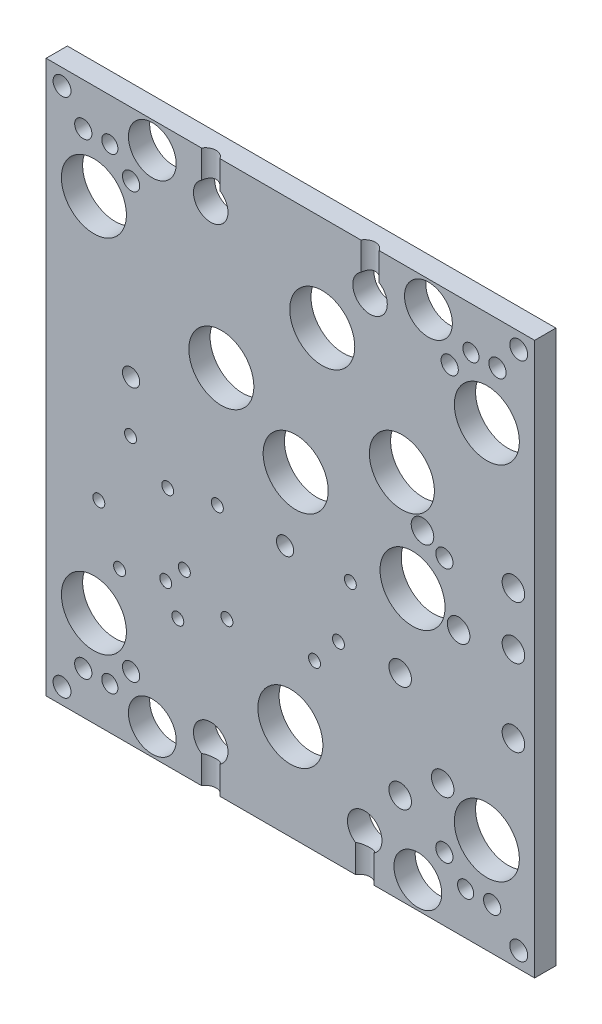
ISO-10303-21;
HEADER;
FILE_DESCRIPTION(('STEP AP214'),'2;1');
FILE_NAME('part.step','',(''),(''),'','','');
FILE_SCHEMA(('AUTOMOTIVE_DESIGN { 1 0 10303 214 1 1 1 1 }'));
ENDSEC;
DATA;
#1=APPLICATION_CONTEXT('core data for automotive mechanical design processes');
#2=APPLICATION_PROTOCOL_DEFINITION('international standard','automotive_design',2000,#1);
#3=PRODUCT_CONTEXT('',#1,'mechanical');
#4=PRODUCT('Part','Part','',(#3));
#5=PRODUCT_RELATED_PRODUCT_CATEGORY('part','',(#4));
#6=PRODUCT_DEFINITION_FORMATION('','',#4);
#7=PRODUCT_DEFINITION_CONTEXT('part definition',#1,'design');
#8=PRODUCT_DEFINITION('design','',#6,#7);
#9=PRODUCT_DEFINITION_SHAPE('','',#8);
#10=(LENGTH_UNIT() NAMED_UNIT(*) SI_UNIT(.MILLI.,.METRE.));
#11=(NAMED_UNIT(*) PLANE_ANGLE_UNIT() SI_UNIT($,.RADIAN.));
#12=(NAMED_UNIT(*) SI_UNIT($,.STERADIAN.) SOLID_ANGLE_UNIT());
#13=UNCERTAINTY_MEASURE_WITH_UNIT(LENGTH_MEASURE(1.E-05),#10,'distance_accuracy_value','');
#14=(GEOMETRIC_REPRESENTATION_CONTEXT(3) GLOBAL_UNCERTAINTY_ASSIGNED_CONTEXT((#13)) GLOBAL_UNIT_ASSIGNED_CONTEXT((#10,
#11,#12)) REPRESENTATION_CONTEXT('',''));
#15=CARTESIAN_POINT('',(0.,0.,0.));
#16=DIRECTION('',(0.,0.,1.));
#17=DIRECTION('',(1.,0.,0.));
#18=AXIS2_PLACEMENT_3D('',#15,#16,#17);
#19=CARTESIAN_POINT('',(-452.12,-180.975,12.7));
#20=DIRECTION('',(-1.,0.,0.));
#21=DIRECTION('',(0.,0.,1.));
#22=AXIS2_PLACEMENT_3D('',#19,#20,#21);
#23=PLANE('',#22);
#24=DIRECTION('',(0.,1.,0.));
#25=VECTOR('',#24,1.);
#26=CARTESIAN_POINT('',(-452.12,-180.975,0.));
#27=LINE('',#26,#25);
#28=CARTESIAN_POINT('',(-452.12,-180.975,0.));
#29=VERTEX_POINT('',#28);
#30=CARTESIAN_POINT('',(-452.12,149.225,0.));
#31=VERTEX_POINT('',#30);
#32=EDGE_CURVE('E174',#29,#31,#27,.T.);
#33=ORIENTED_EDGE('',*,*,#32,.T.);
#34=DIRECTION('',(0.,0.,-1.));
#35=VECTOR('',#34,1.);
#36=CARTESIAN_POINT('',(-452.12,149.225,12.7));
#37=LINE('',#36,#35);
#38=CARTESIAN_POINT('',(-452.12,149.225,12.7));
#39=VERTEX_POINT('',#38);
#40=EDGE_CURVE('E11',#39,#31,#37,.T.);
#41=ORIENTED_EDGE('',*,*,#40,.F.);
#42=DIRECTION('',(0.,1.,0.));
#43=VECTOR('',#42,1.);
#44=CARTESIAN_POINT('',(-452.12,-180.975,12.7));
#45=LINE('',#44,#43);
#46=CARTESIAN_POINT('',(-452.12,-180.975,12.7));
#47=VERTEX_POINT('',#46);
#48=EDGE_CURVE('E154',#47,#39,#45,.T.);
#49=ORIENTED_EDGE('',*,*,#48,.F.);
#50=DIRECTION('',(0.,0.,-1.));
#51=VECTOR('',#50,1.);
#52=CARTESIAN_POINT('',(-452.12,-180.975,12.7));
#53=LINE('',#52,#51);
#54=EDGE_CURVE('E754',#47,#29,#53,.T.);
#55=ORIENTED_EDGE('',*,*,#54,.T.);
#56=EDGE_LOOP('',(#33,#41,#49,#55));
#57=FACE_BOUND('',#56,.T.);
#58=ADVANCED_FACE('F45',(#57),#23,.F.);
#59=CARTESIAN_POINT('',(-452.12,149.225,12.7));
#60=DIRECTION('',(0.,-1.,0.));
#61=DIRECTION('',(0.,0.,-1.));
#62=AXIS2_PLACEMENT_3D('',#59,#60,#61);
#63=PLANE('',#62);
#64=DIRECTION('',(-1.,0.,0.));
#65=VECTOR('',#64,1.);
#66=CARTESIAN_POINT('',(-452.12,149.225,12.7));
#67=LINE('',#66,#65);
#68=CARTESIAN_POINT('',(-556.044261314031,149.225,12.7));
#69=VERTEX_POINT('',#68);
#70=CARTESIAN_POINT('',(-640.295738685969,149.225,12.7));
#71=VERTEX_POINT('',#70);
#72=EDGE_CURVE('E148',#69,#71,#67,.T.);
#73=ORIENTED_EDGE('',*,*,#72,.F.);
#74=CARTESIAN_POINT('',(-550.545,149.225,15.875));
#75=DIRECTION('',(0.,1.,0.));
#76=DIRECTION('',(0.,0.,1.));
#77=AXIS2_PLACEMENT_3D('',#74,#75,#76);
#78=CIRCLE('',#77,6.34999999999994);
#79=CARTESIAN_POINT('',(-545.045738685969,149.225,12.7));
#80=VERTEX_POINT('',#79);
#81=EDGE_CURVE('E134',#80,#69,#78,.T.);
#82=ORIENTED_EDGE('',*,*,#81,.F.);
#83=EDGE_CURVE('E144',#39,#80,#67,.T.);
#84=ORIENTED_EDGE('',*,*,#83,.F.);
#85=ORIENTED_EDGE('',*,*,#40,.T.);
#86=DIRECTION('',(-1.,0.,0.));
#87=VECTOR('',#86,1.);
#88=CARTESIAN_POINT('',(-452.12,149.225,0.));
#89=LINE('',#88,#87);
#90=CARTESIAN_POINT('',(-744.22,149.225,0.));
#91=VERTEX_POINT('',#90);
#92=EDGE_CURVE('E758',#31,#91,#89,.T.);
#93=ORIENTED_EDGE('',*,*,#92,.T.);
#94=DIRECTION('',(0.,0.,-1.));
#95=VECTOR('',#94,1.);
#96=CARTESIAN_POINT('',(-744.22,149.225,12.7));
#97=LINE('',#96,#95);
#98=CARTESIAN_POINT('',(-744.22,149.225,12.7));
#99=VERTEX_POINT('',#98);
#100=EDGE_CURVE('E52',#99,#91,#97,.T.);
#101=ORIENTED_EDGE('',*,*,#100,.F.);
#102=CARTESIAN_POINT('',(-651.294261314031,149.225,12.7));
#103=VERTEX_POINT('',#102);
#104=EDGE_CURVE('E158',#103,#99,#67,.T.);
#105=ORIENTED_EDGE('',*,*,#104,.F.);
#106=CARTESIAN_POINT('',(-645.795,149.225,15.875));
#107=DIRECTION('',(0.,1.,0.));
#108=DIRECTION('',(0.,0.,1.));
#109=AXIS2_PLACEMENT_3D('',#106,#107,#108);
#110=CIRCLE('',#109,6.34999999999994);
#111=EDGE_CURVE('E149',#71,#103,#110,.T.);
#112=ORIENTED_EDGE('',*,*,#111,.F.);
#113=EDGE_LOOP('',(#73,#82,#84,#85,#93,#101,#105,#112));
#114=FACE_BOUND('',#113,.T.);
#115=ADVANCED_FACE('F143',(#114),#63,.F.);
#116=CARTESIAN_POINT('',(-744.22,149.225,12.7));
#117=DIRECTION('',(1.,0.,0.));
#118=DIRECTION('',(0.,0.,-1.));
#119=AXIS2_PLACEMENT_3D('',#116,#117,#118);
#120=PLANE('',#119);
#121=DIRECTION('',(0.,-1.,0.));
#122=VECTOR('',#121,1.);
#123=CARTESIAN_POINT('',(-744.22,149.225,0.));
#124=LINE('',#123,#122);
#125=CARTESIAN_POINT('',(-744.22,-180.975,0.));
#126=VERTEX_POINT('',#125);
#127=EDGE_CURVE('E168',#91,#126,#124,.T.);
#128=ORIENTED_EDGE('',*,*,#127,.T.);
#129=DIRECTION('',(0.,0.,-1.));
#130=VECTOR('',#129,1.);
#131=CARTESIAN_POINT('',(-744.22,-180.975,12.7));
#132=LINE('',#131,#130);
#133=CARTESIAN_POINT('',(-744.22,-180.975,12.7));
#134=VERTEX_POINT('',#133);
#135=EDGE_CURVE('E767',#134,#126,#132,.T.);
#136=ORIENTED_EDGE('',*,*,#135,.F.);
#137=DIRECTION('',(0.,-1.,0.));
#138=VECTOR('',#137,1.);
#139=CARTESIAN_POINT('',(-744.22,149.225,12.7));
#140=LINE('',#139,#138);
#141=EDGE_CURVE('E156',#99,#134,#140,.T.);
#142=ORIENTED_EDGE('',*,*,#141,.F.);
#143=ORIENTED_EDGE('',*,*,#100,.T.);
#144=EDGE_LOOP('',(#128,#136,#142,#143));
#145=FACE_BOUND('',#144,.T.);
#146=ADVANCED_FACE('F737',(#145),#120,.F.);
#147=CARTESIAN_POINT('',(-744.22,-180.975,12.7));
#148=DIRECTION('',(0.,1.,0.));
#149=DIRECTION('',(-1.,0.,0.));
#150=AXIS2_PLACEMENT_3D('',#147,#148,#149);
#151=PLANE('',#150);
#152=DIRECTION('',(1.,0.,0.));
#153=VECTOR('',#152,1.);
#154=CARTESIAN_POINT('',(-744.22,-180.975,12.7));
#155=LINE('',#154,#153);
#156=CARTESIAN_POINT('',(-548.220738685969,-180.975,12.7));
#157=VERTEX_POINT('',#156);
#158=EDGE_CURVE('E159',#157,#47,#155,.T.);
#159=ORIENTED_EDGE('',*,*,#158,.F.);
#160=CARTESIAN_POINT('',(-553.72,-180.975,15.875));
#161=DIRECTION('',(0.,-1.,0.));
#162=DIRECTION('',(1.,0.,0.));
#163=AXIS2_PLACEMENT_3D('',#160,#161,#162);
#164=CIRCLE('',#163,6.34999999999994);
#165=CARTESIAN_POINT('',(-559.219261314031,-180.975,12.7));
#166=VERTEX_POINT('',#165);
#167=EDGE_CURVE('E785',#166,#157,#164,.T.);
#168=ORIENTED_EDGE('',*,*,#167,.F.);
#169=CARTESIAN_POINT('',(-640.295738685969,-180.975,12.7));
#170=VERTEX_POINT('',#169);
#171=EDGE_CURVE('E779',#170,#166,#155,.T.);
#172=ORIENTED_EDGE('',*,*,#171,.F.);
#173=CARTESIAN_POINT('',(-645.795,-180.975,15.875));
#174=DIRECTION('',(0.,-1.,0.));
#175=DIRECTION('',(1.,0.,0.));
#176=AXIS2_PLACEMENT_3D('',#173,#174,#175);
#177=CIRCLE('',#176,6.34999999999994);
#178=CARTESIAN_POINT('',(-651.294261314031,-180.975,12.7));
#179=VERTEX_POINT('',#178);
#180=EDGE_CURVE('E499',#179,#170,#177,.T.);
#181=ORIENTED_EDGE('',*,*,#180,.F.);
#182=EDGE_CURVE('E763',#134,#179,#155,.T.);
#183=ORIENTED_EDGE('',*,*,#182,.F.);
#184=ORIENTED_EDGE('',*,*,#135,.T.);
#185=DIRECTION('',(1.,0.,0.));
#186=VECTOR('',#185,1.);
#187=CARTESIAN_POINT('',(-744.22,-180.975,0.));
#188=LINE('',#187,#186);
#189=EDGE_CURVE('E165',#126,#29,#188,.T.);
#190=ORIENTED_EDGE('',*,*,#189,.T.);
#191=ORIENTED_EDGE('',*,*,#54,.F.);
#192=EDGE_LOOP('',(#159,#168,#172,#181,#183,#184,#190,#191));
#193=FACE_BOUND('',#192,.T.);
#194=ADVANCED_FACE('F730',(#193),#151,.F.);
#195=CARTESIAN_POINT('',(0.,0.,12.7));
#196=DIRECTION('',(0.,0.,1.));
#197=DIRECTION('',(1.,0.,0.));
#198=AXIS2_PLACEMENT_3D('',#195,#196,#197);
#199=PLANE('',#198);
#200=CARTESIAN_POINT('',(-532.511,-126.6825,12.7));
#201=DIRECTION('',(0.,0.,1.));
#202=DIRECTION('',(1.,0.,0.));
#203=AXIS2_PLACEMENT_3D('',#200,#201,#202);
#204=CIRCLE('',#203,6.74687500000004);
#205=CARTESIAN_POINT('',(-525.764125,-126.6825,12.7));
#206=VERTEX_POINT('',#205);
#207=EDGE_CURVE('E899',#206,#206,#204,.T.);
#208=ORIENTED_EDGE('',*,*,#207,.F.);
#209=EDGE_LOOP('',(#208));
#210=FACE_BOUND('',#209,.T.);
#211=CARTESIAN_POINT('',(-507.111,-107.6325,12.7));
#212=DIRECTION('',(0.,0.,1.));
#213=DIRECTION('',(1.,0.,0.));
#214=AXIS2_PLACEMENT_3D('',#211,#212,#213);
#215=CIRCLE('',#214,6.74687500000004);
#216=CARTESIAN_POINT('',(-500.364125,-107.6325,12.7));
#217=VERTEX_POINT('',#216);
#218=EDGE_CURVE('E893',#217,#217,#215,.T.);
#219=ORIENTED_EDGE('',*,*,#218,.F.);
#220=EDGE_LOOP('',(#219));
#221=FACE_BOUND('',#220,.T.);
#222=CARTESIAN_POINT('',(-464.82,14.605,12.7));
#223=DIRECTION('',(0.,0.,1.));
#224=DIRECTION('',(1.,0.,0.));
#225=AXIS2_PLACEMENT_3D('',#222,#223,#224);
#226=CIRCLE('',#225,6.74687499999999);
#227=CARTESIAN_POINT('',(-458.073125,14.605,12.7));
#228=VERTEX_POINT('',#227);
#229=EDGE_CURVE('E887',#228,#228,#226,.T.);
#230=ORIENTED_EDGE('',*,*,#229,.F.);
#231=EDGE_LOOP('',(#230));
#232=FACE_BOUND('',#231,.T.);
#233=CARTESIAN_POINT('',(-519.176,17.145,12.7));
#234=DIRECTION('',(0.,0.,1.));
#235=DIRECTION('',(1.,0.,0.));
#236=AXIS2_PLACEMENT_3D('',#233,#234,#235);
#237=CIRCLE('',#236,6.74687500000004);
#238=CARTESIAN_POINT('',(-512.429125,17.145,12.7));
#239=VERTEX_POINT('',#238);
#240=EDGE_CURVE('E879',#239,#239,#237,.T.);
#241=ORIENTED_EDGE('',*,*,#240,.F.);
#242=EDGE_LOOP('',(#241));
#243=FACE_BOUND('',#242,.T.);
#244=CARTESIAN_POINT('',(-532.511,-63.1825,12.7));
#245=DIRECTION('',(0.,0.,1.));
#246=DIRECTION('',(1.,0.,0.));
#247=AXIS2_PLACEMENT_3D('',#244,#245,#246);
#248=CIRCLE('',#247,6.74687500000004);
#249=CARTESIAN_POINT('',(-525.764125,-63.1825,12.7));
#250=VERTEX_POINT('',#249);
#251=EDGE_CURVE('E873',#250,#250,#248,.T.);
#252=ORIENTED_EDGE('',*,*,#251,.F.);
#253=EDGE_LOOP('',(#252));
#254=FACE_BOUND('',#253,.T.);
#255=CARTESIAN_POINT('',(-497.586,-23.495,12.7));
#256=DIRECTION('',(0.,0.,1.));
#257=DIRECTION('',(1.,0.,0.));
#258=AXIS2_PLACEMENT_3D('',#255,#256,#257);
#259=CIRCLE('',#258,6.74687499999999);
#260=CARTESIAN_POINT('',(-490.839125,-23.495,12.7));
#261=VERTEX_POINT('',#260);
#262=EDGE_CURVE('E867',#261,#261,#259,.T.);
#263=ORIENTED_EDGE('',*,*,#262,.F.);
#264=EDGE_LOOP('',(#263));
#265=FACE_BOUND('',#264,.T.);
#266=CARTESIAN_POINT('',(-464.82,-63.1825,12.7));
#267=DIRECTION('',(0.,0.,1.));
#268=DIRECTION('',(1.,0.,0.));
#269=AXIS2_PLACEMENT_3D('',#266,#267,#268);
#270=CIRCLE('',#269,6.74687499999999);
#271=CARTESIAN_POINT('',(-458.073125,-63.1825,12.7));
#272=VERTEX_POINT('',#271);
#273=EDGE_CURVE('E861',#272,#272,#270,.T.);
#274=ORIENTED_EDGE('',*,*,#273,.F.);
#275=EDGE_LOOP('',(#274));
#276=FACE_BOUND('',#275,.T.);
#277=CARTESIAN_POINT('',(-464.82,-17.145,12.7));
#278=DIRECTION('',(0.,0.,1.));
#279=DIRECTION('',(1.,0.,0.));
#280=AXIS2_PLACEMENT_3D('',#277,#278,#279);
#281=CIRCLE('',#280,6.74687499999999);
#282=CARTESIAN_POINT('',(-458.073125,-17.145,12.7));
#283=VERTEX_POINT('',#282);
#284=EDGE_CURVE('E855',#283,#283,#281,.T.);
#285=ORIENTED_EDGE('',*,*,#284,.F.);
#286=EDGE_LOOP('',(#285));
#287=FACE_BOUND('',#286,.T.);
#288=CARTESIAN_POINT('',(-525.145,-15.875,12.7));
#289=DIRECTION('',(0.,0.,1.));
#290=DIRECTION('',(1.,0.,0.));
#291=AXIS2_PLACEMENT_3D('',#288,#289,#290);
#292=CIRCLE('',#291,19.4437);
#293=CARTESIAN_POINT('',(-505.7013,-15.875,12.7));
#294=VERTEX_POINT('',#293);
#295=EDGE_CURVE('E846',#294,#294,#292,.T.);
#296=ORIENTED_EDGE('',*,*,#295,.F.);
#297=EDGE_LOOP('',(#296));
#298=FACE_BOUND('',#297,.T.);
#299=CARTESIAN_POINT('',(-480.695,-123.825,12.7));
#300=DIRECTION('',(0.,0.,1.));
#301=DIRECTION('',(1.,0.,0.));
#302=AXIS2_PLACEMENT_3D('',#299,#300,#301);
#303=CIRCLE('',#302,19.4437);
#304=CARTESIAN_POINT('',(-461.2513,-123.825,12.7));
#305=VERTEX_POINT('',#304);
#306=EDGE_CURVE('E832',#305,#305,#303,.T.);
#307=ORIENTED_EDGE('',*,*,#306,.F.);
#308=EDGE_LOOP('',(#307));
#309=FACE_BOUND('',#308,.T.);
#310=DIRECTION('',(0.,1.,0.));
#311=VECTOR('',#310,1.);
#312=CARTESIAN_POINT('',(-545.045738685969,-180.976,12.7));
#313=LINE('',#312,#311);
#314=CARTESIAN_POINT('',(-545.045738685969,132.55625,12.7));
#315=VERTEX_POINT('',#314);
#316=EDGE_CURVE('E131',#80,#315,#313,.F.);
#317=ORIENTED_EDGE('',*,*,#316,.T.);
#318=CARTESIAN_POINT('',(-550.545,123.825,12.7));
#319=DIRECTION('',(0.,0.,1.));
#320=DIRECTION('',(1.,0.,0.));
#321=AXIS2_PLACEMENT_3D('',#318,#319,#320);
#322=CIRCLE('',#321,10.31875);
#323=CARTESIAN_POINT('',(-556.044261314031,132.55625,12.7));
#324=VERTEX_POINT('',#323);
#325=EDGE_CURVE('E454',#324,#315,#322,.T.);
#326=ORIENTED_EDGE('',*,*,#325,.F.);
#327=DIRECTION('',(0.,1.,0.));
#328=VECTOR('',#327,1.);
#329=CARTESIAN_POINT('',(-556.044261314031,-180.976,12.7));
#330=LINE('',#329,#328);
#331=EDGE_CURVE('E59',#324,#69,#330,.T.);
#332=ORIENTED_EDGE('',*,*,#331,.T.);
#333=ORIENTED_EDGE('',*,*,#72,.T.);
#334=DIRECTION('',(0.,1.,0.));
#335=VECTOR('',#334,1.);
#336=CARTESIAN_POINT('',(-640.295738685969,-180.976,12.7));
#337=LINE('',#336,#335);
#338=CARTESIAN_POINT('',(-640.295738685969,132.55625,12.7));
#339=VERTEX_POINT('',#338);
#340=EDGE_CURVE('E836',#71,#339,#337,.F.);
#341=ORIENTED_EDGE('',*,*,#340,.T.);
#342=CARTESIAN_POINT('',(-645.795,123.825,12.7));
#343=DIRECTION('',(0.,0.,1.));
#344=DIRECTION('',(1.,0.,0.));
#345=AXIS2_PLACEMENT_3D('',#342,#343,#344);
#346=CIRCLE('',#345,10.31875);
#347=CARTESIAN_POINT('',(-651.294261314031,132.55625,12.7));
#348=VERTEX_POINT('',#347);
#349=EDGE_CURVE('E459',#348,#339,#346,.T.);
#350=ORIENTED_EDGE('',*,*,#349,.F.);
#351=DIRECTION('',(0.,1.,0.));
#352=VECTOR('',#351,1.);
#353=CARTESIAN_POINT('',(-651.294261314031,-180.976,12.7));
#354=LINE('',#353,#352);
#355=EDGE_CURVE('E67',#348,#103,#354,.T.);
#356=ORIENTED_EDGE('',*,*,#355,.T.);
#357=ORIENTED_EDGE('',*,*,#104,.T.);
#358=ORIENTED_EDGE('',*,*,#141,.T.);
#359=ORIENTED_EDGE('',*,*,#182,.T.);
#360=DIRECTION('',(0.,-1.,0.));
#361=VECTOR('',#360,1.);
#362=CARTESIAN_POINT('',(-651.294261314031,149.226,12.7));
#363=LINE('',#362,#361);
#364=CARTESIAN_POINT('',(-651.294261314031,-164.30625,12.7));
#365=VERTEX_POINT('',#364);
#366=EDGE_CURVE('E794',#179,#365,#363,.F.);
#367=ORIENTED_EDGE('',*,*,#366,.T.);
#368=CARTESIAN_POINT('',(-645.795,-155.575,12.7));
#369=DIRECTION('',(0.,0.,1.));
#370=DIRECTION('',(1.,0.,0.));
#371=AXIS2_PLACEMENT_3D('',#368,#369,#370);
#372=CIRCLE('',#371,10.31875);
#373=CARTESIAN_POINT('',(-640.295738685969,-164.30625,12.7));
#374=VERTEX_POINT('',#373);
#375=EDGE_CURVE('E442',#374,#365,#372,.T.);
#376=ORIENTED_EDGE('',*,*,#375,.F.);
#377=DIRECTION('',(0.,-1.,0.));
#378=VECTOR('',#377,1.);
#379=CARTESIAN_POINT('',(-640.295738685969,149.226,12.7));
#380=LINE('',#379,#378);
#381=EDGE_CURVE('E498',#374,#170,#380,.T.);
#382=ORIENTED_EDGE('',*,*,#381,.T.);
#383=ORIENTED_EDGE('',*,*,#171,.T.);
#384=DIRECTION('',(0.,-1.,0.));
#385=VECTOR('',#384,1.);
#386=CARTESIAN_POINT('',(-559.219261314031,149.226,12.7));
#387=LINE('',#386,#385);
#388=CARTESIAN_POINT('',(-559.219261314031,-164.30625,12.7));
#389=VERTEX_POINT('',#388);
#390=EDGE_CURVE('E787',#166,#389,#387,.F.);
#391=ORIENTED_EDGE('',*,*,#390,.T.);
#392=CARTESIAN_POINT('',(-553.72,-155.575,12.7));
#393=DIRECTION('',(0.,0.,1.));
#394=DIRECTION('',(1.,0.,0.));
#395=AXIS2_PLACEMENT_3D('',#392,#393,#394);
#396=CIRCLE('',#395,10.31875);
#397=CARTESIAN_POINT('',(-548.220738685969,-164.30625,12.7));
#398=VERTEX_POINT('',#397);
#399=EDGE_CURVE('E448',#398,#389,#396,.T.);
#400=ORIENTED_EDGE('',*,*,#399,.F.);
#401=DIRECTION('',(0.,-1.,0.));
#402=VECTOR('',#401,1.);
#403=CARTESIAN_POINT('',(-548.220738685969,149.226,12.7));
#404=LINE('',#403,#402);
#405=EDGE_CURVE('E783',#398,#157,#404,.T.);
#406=ORIENTED_EDGE('',*,*,#405,.T.);
#407=ORIENTED_EDGE('',*,*,#158,.T.);
#408=ORIENTED_EDGE('',*,*,#48,.T.);
#409=ORIENTED_EDGE('',*,*,#83,.T.);
#410=EDGE_LOOP('',(#317,#326,#332,#333,#341,#350,#356,#357,#358,#359,#367,#376,#382,#383,#391,
#400,#406,#407,#408,#409));
#411=FACE_BOUND('',#410,.T.);
#412=CARTESIAN_POINT('',(-693.42,-142.875,12.7));
#413=DIRECTION('',(0.,0.,-1.));
#414=DIRECTION('',(-1.,0.,0.));
#415=AXIS2_PLACEMENT_3D('',#412,#413,#414);
#416=CIRCLE('',#415,5.15937499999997);
#417=CARTESIAN_POINT('',(-698.579375,-142.875,12.7));
#418=VERTEX_POINT('',#417);
#419=EDGE_CURVE('E486',#418,#418,#416,.T.);
#420=ORIENTED_EDGE('',*,*,#419,.T.);
#421=EDGE_LOOP('',(#420));
#422=FACE_BOUND('',#421,.T.);
#423=CARTESIAN_POINT('',(-506.095,-142.875,12.7));
#424=DIRECTION('',(0.,0.,-1.));
#425=DIRECTION('',(-1.,0.,0.));
#426=AXIS2_PLACEMENT_3D('',#423,#424,#425);
#427=CIRCLE('',#426,5.15937499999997);
#428=CARTESIAN_POINT('',(-511.254375,-142.875,12.7));
#429=VERTEX_POINT('',#428);
#430=EDGE_CURVE('E480',#429,#429,#427,.T.);
#431=ORIENTED_EDGE('',*,*,#430,.T.);
#432=EDGE_LOOP('',(#431));
#433=FACE_BOUND('',#432,.T.);
#434=CARTESIAN_POINT('',(-502.92,111.125,12.7));
#435=DIRECTION('',(0.,0.,-1.));
#436=DIRECTION('',(-1.,0.,0.));
#437=AXIS2_PLACEMENT_3D('',#434,#435,#436);
#438=CIRCLE('',#437,5.15937500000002);
#439=CARTESIAN_POINT('',(-508.079375,111.125,12.7));
#440=VERTEX_POINT('',#439);
#441=EDGE_CURVE('E474',#440,#440,#438,.T.);
#442=ORIENTED_EDGE('',*,*,#441,.T.);
#443=EDGE_LOOP('',(#442));
#444=FACE_BOUND('',#443,.T.);
#445=CARTESIAN_POINT('',(-693.42,111.125,12.7));
#446=DIRECTION('',(0.,0.,-1.));
#447=DIRECTION('',(-1.,0.,0.));
#448=AXIS2_PLACEMENT_3D('',#445,#446,#447);
#449=CIRCLE('',#448,5.15937499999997);
#450=CARTESIAN_POINT('',(-698.579375,111.125,12.7));
#451=VERTEX_POINT('',#450);
#452=EDGE_CURVE('E468',#451,#451,#449,.T.);
#453=ORIENTED_EDGE('',*,*,#452,.T.);
#454=EDGE_LOOP('',(#453));
#455=FACE_BOUND('',#454,.T.);
#456=CARTESIAN_POINT('',(-734.695,139.7,12.7));
#457=DIRECTION('',(0.,0.,1.));
#458=DIRECTION('',(1.,0.,0.));
#459=AXIS2_PLACEMENT_3D('',#456,#457,#458);
#460=CIRCLE('',#459,5.35940000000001);
#461=CARTESIAN_POINT('',(-729.3356,139.7,12.7));
#462=VERTEX_POINT('',#461);
#463=EDGE_CURVE('E430',#462,#462,#460,.T.);
#464=ORIENTED_EDGE('',*,*,#463,.F.);
#465=EDGE_LOOP('',(#464));
#466=FACE_BOUND('',#465,.T.);
#467=CARTESIAN_POINT('',(-461.645,139.7,12.7));
#468=DIRECTION('',(0.,0.,1.));
#469=DIRECTION('',(1.,0.,0.));
#470=AXIS2_PLACEMENT_3D('',#467,#468,#469);
#471=CIRCLE('',#470,5.35940000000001);
#472=CARTESIAN_POINT('',(-456.2856,139.7,12.7));
#473=VERTEX_POINT('',#472);
#474=EDGE_CURVE('E418',#473,#473,#471,.T.);
#475=ORIENTED_EDGE('',*,*,#474,.F.);
#476=EDGE_LOOP('',(#475));
#477=FACE_BOUND('',#476,.T.);
#478=CARTESIAN_POINT('',(-461.645,-171.45,12.7));
#479=DIRECTION('',(0.,0.,1.));
#480=DIRECTION('',(1.,0.,0.));
#481=AXIS2_PLACEMENT_3D('',#478,#479,#480);
#482=CIRCLE('',#481,5.35940000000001);
#483=CARTESIAN_POINT('',(-456.2856,-171.45,12.7));
#484=VERTEX_POINT('',#483);
#485=EDGE_CURVE('E406',#484,#484,#482,.T.);
#486=ORIENTED_EDGE('',*,*,#485,.F.);
#487=EDGE_LOOP('',(#486));
#488=FACE_BOUND('',#487,.T.);
#489=CARTESIAN_POINT('',(-734.695,-171.45,12.7));
#490=DIRECTION('',(0.,0.,1.));
#491=DIRECTION('',(1.,0.,0.));
#492=AXIS2_PLACEMENT_3D('',#489,#490,#491);
#493=CIRCLE('',#492,5.35940000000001);
#494=CARTESIAN_POINT('',(-729.3356,-171.45,12.7));
#495=VERTEX_POINT('',#494);
#496=EDGE_CURVE('E394',#495,#495,#493,.T.);
#497=ORIENTED_EDGE('',*,*,#496,.F.);
#498=EDGE_LOOP('',(#497));
#499=FACE_BOUND('',#498,.T.);
#500=CARTESIAN_POINT('',(-493.395,-155.575,12.7));
#501=DIRECTION('',(0.,0.,1.));
#502=DIRECTION('',(1.,0.,0.));
#503=AXIS2_PLACEMENT_3D('',#500,#501,#502);
#504=CIRCLE('',#503,4.826);
#505=CARTESIAN_POINT('',(-488.569,-155.575,12.7));
#506=VERTEX_POINT('',#505);
#507=EDGE_CURVE('E388',#506,#506,#504,.T.);
#508=ORIENTED_EDGE('',*,*,#507,.F.);
#509=EDGE_LOOP('',(#508));
#510=FACE_BOUND('',#509,.T.);
#511=CARTESIAN_POINT('',(-706.12,-155.575,12.7));
#512=DIRECTION('',(0.,0.,1.));
#513=DIRECTION('',(1.,0.,0.));
#514=AXIS2_PLACEMENT_3D('',#511,#512,#513);
#515=CIRCLE('',#514,4.826);
#516=CARTESIAN_POINT('',(-701.294,-155.575,12.7));
#517=VERTEX_POINT('',#516);
#518=EDGE_CURVE('E382',#517,#517,#515,.T.);
#519=ORIENTED_EDGE('',*,*,#518,.F.);
#520=EDGE_LOOP('',(#519));
#521=FACE_BOUND('',#520,.T.);
#522=CARTESIAN_POINT('',(-706.12,123.825,12.7));
#523=DIRECTION('',(0.,0.,1.));
#524=DIRECTION('',(1.,0.,0.));
#525=AXIS2_PLACEMENT_3D('',#522,#523,#524);
#526=CIRCLE('',#525,4.826);
#527=CARTESIAN_POINT('',(-701.294,123.825,12.7));
#528=VERTEX_POINT('',#527);
#529=EDGE_CURVE('E376',#528,#528,#526,.T.);
#530=ORIENTED_EDGE('',*,*,#529,.F.);
#531=EDGE_LOOP('',(#530));
#532=FACE_BOUND('',#531,.T.);
#533=CARTESIAN_POINT('',(-490.22,123.825,12.7));
#534=DIRECTION('',(0.,0.,1.));
#535=DIRECTION('',(1.,0.,0.));
#536=AXIS2_PLACEMENT_3D('',#533,#534,#535);
#537=CIRCLE('',#536,4.826);
#538=CARTESIAN_POINT('',(-485.394,123.825,12.7));
#539=VERTEX_POINT('',#538);
#540=EDGE_CURVE('E370',#539,#539,#537,.T.);
#541=ORIENTED_EDGE('',*,*,#540,.F.);
#542=EDGE_LOOP('',(#541));
#543=FACE_BOUND('',#542,.T.);
#544=CARTESIAN_POINT('',(-721.995,123.825,12.7));
#545=DIRECTION('',(0.,0.,-1.));
#546=DIRECTION('',(-1.,0.,0.));
#547=AXIS2_PLACEMENT_3D('',#544,#545,#546);
#548=CIRCLE('',#547,5.15619999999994);
#549=CARTESIAN_POINT('',(-727.1512,123.825,12.7));
#550=VERTEX_POINT('',#549);
#551=EDGE_CURVE('E367',#550,#550,#548,.T.);
#552=ORIENTED_EDGE('',*,*,#551,.T.);
#553=EDGE_LOOP('',(#552));
#554=FACE_BOUND('',#553,.T.);
#555=CARTESIAN_POINT('',(-474.345,123.825,12.7));
#556=DIRECTION('',(0.,0.,-1.));
#557=DIRECTION('',(-1.,0.,0.));
#558=AXIS2_PLACEMENT_3D('',#555,#556,#557);
#559=CIRCLE('',#558,5.1562);
#560=CARTESIAN_POINT('',(-479.5012,123.825,12.7));
#561=VERTEX_POINT('',#560);
#562=EDGE_CURVE('E361',#561,#561,#559,.T.);
#563=ORIENTED_EDGE('',*,*,#562,.T.);
#564=EDGE_LOOP('',(#563));
#565=FACE_BOUND('',#564,.T.);
#566=CARTESIAN_POINT('',(-477.52,-155.575,12.7));
#567=DIRECTION('',(0.,0.,-1.));
#568=DIRECTION('',(-1.,0.,0.));
#569=AXIS2_PLACEMENT_3D('',#566,#567,#568);
#570=CIRCLE('',#569,5.1562);
#571=CARTESIAN_POINT('',(-482.6762,-155.575,12.7));
#572=VERTEX_POINT('',#571);
#573=EDGE_CURVE('E355',#572,#572,#570,.T.);
#574=ORIENTED_EDGE('',*,*,#573,.T.);
#575=EDGE_LOOP('',(#574));
#576=FACE_BOUND('',#575,.T.);
#577=CARTESIAN_POINT('',(-721.995,-155.575,12.7));
#578=DIRECTION('',(0.,0.,-1.));
#579=DIRECTION('',(-1.,0.,0.));
#580=AXIS2_PLACEMENT_3D('',#577,#578,#579);
#581=CIRCLE('',#580,5.15619999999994);
#582=CARTESIAN_POINT('',(-727.1512,-155.575,12.7));
#583=VERTEX_POINT('',#582);
#584=EDGE_CURVE('E349',#583,#583,#581,.T.);
#585=ORIENTED_EDGE('',*,*,#584,.T.);
#586=EDGE_LOOP('',(#585));
#587=FACE_BOUND('',#586,.T.);
#588=CARTESIAN_POINT('',(-601.345,-31.75,12.7));
#589=DIRECTION('',(0.,0.,-1.));
#590=DIRECTION('',(-1.,0.,0.));
#591=AXIS2_PLACEMENT_3D('',#588,#589,#590);
#592=CIRCLE('',#591,5.15619999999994);
#593=CARTESIAN_POINT('',(-606.5012,-31.75,12.7));
#594=VERTEX_POINT('',#593);
#595=EDGE_CURVE('E342',#594,#594,#592,.T.);
#596=ORIENTED_EDGE('',*,*,#595,.T.);
#597=EDGE_LOOP('',(#596));
#598=FACE_BOUND('',#597,.T.);
#599=CARTESIAN_POINT('',(-506.095,9.52499999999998,12.7));
#600=DIRECTION('',(0.,0.,-1.));
#601=DIRECTION('',(-1.,0.,0.));
#602=AXIS2_PLACEMENT_3D('',#599,#600,#601);
#603=CIRCLE('',#602,5.15619999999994);
#604=CARTESIAN_POINT('',(-511.2512,9.52499999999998,12.7));
#605=VERTEX_POINT('',#604);
#606=EDGE_CURVE('E336',#605,#605,#603,.T.);
#607=ORIENTED_EDGE('',*,*,#606,.T.);
#608=EDGE_LOOP('',(#607));
#609=FACE_BOUND('',#608,.T.);
#610=CARTESIAN_POINT('',(-693.42,9.52499999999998,12.7));
#611=DIRECTION('',(0.,0.,-1.));
#612=DIRECTION('',(-1.,0.,0.));
#613=AXIS2_PLACEMENT_3D('',#610,#611,#612);
#614=CIRCLE('',#613,5.15619999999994);
#615=CARTESIAN_POINT('',(-698.5762,9.52499999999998,12.7));
#616=VERTEX_POINT('',#615);
#617=EDGE_CURVE('E329',#616,#616,#614,.T.);
#618=ORIENTED_EDGE('',*,*,#617,.T.);
#619=EDGE_LOOP('',(#618));
#620=FACE_BOUND('',#619,.T.);
#621=CARTESIAN_POINT('',(-521.97,-165.1,12.7));
#622=DIRECTION('',(0.,0.,-1.));
#623=DIRECTION('',(-1.,0.,0.));
#624=AXIS2_PLACEMENT_3D('',#621,#622,#623);
#625=CIRCLE('',#624,14.2875);
#626=CARTESIAN_POINT('',(-536.2575,-165.1,12.7));
#627=VERTEX_POINT('',#626);
#628=EDGE_CURVE('E323',#627,#627,#625,.T.);
#629=ORIENTED_EDGE('',*,*,#628,.T.);
#630=EDGE_LOOP('',(#629));
#631=FACE_BOUND('',#630,.T.);
#632=CARTESIAN_POINT('',(-515.62,133.35,12.7));
#633=DIRECTION('',(0.,0.,-1.));
#634=DIRECTION('',(-1.,0.,0.));
#635=AXIS2_PLACEMENT_3D('',#632,#633,#634);
#636=CIRCLE('',#635,14.2875);
#637=CARTESIAN_POINT('',(-529.9075,133.35,12.7));
#638=VERTEX_POINT('',#637);
#639=EDGE_CURVE('E317',#638,#638,#636,.T.);
#640=ORIENTED_EDGE('',*,*,#639,.T.);
#641=EDGE_LOOP('',(#640));
#642=FACE_BOUND('',#641,.T.);
#643=CARTESIAN_POINT('',(-680.72,133.35,12.7));
#644=DIRECTION('',(0.,0.,-1.));
#645=DIRECTION('',(-1.,0.,0.));
#646=AXIS2_PLACEMENT_3D('',#643,#644,#645);
#647=CIRCLE('',#646,14.2875);
#648=CARTESIAN_POINT('',(-695.0075,133.35,12.7));
#649=VERTEX_POINT('',#648);
#650=EDGE_CURVE('E311',#649,#649,#647,.T.);
#651=ORIENTED_EDGE('',*,*,#650,.T.);
#652=EDGE_LOOP('',(#651));
#653=FACE_BOUND('',#652,.T.);
#654=CARTESIAN_POINT('',(-680.72,-165.1,12.7));
#655=DIRECTION('',(0.,0.,-1.));
#656=DIRECTION('',(-1.,0.,0.));
#657=AXIS2_PLACEMENT_3D('',#654,#655,#656);
#658=CIRCLE('',#657,14.2875);
#659=CARTESIAN_POINT('',(-695.0075,-165.1,12.7));
#660=VERTEX_POINT('',#659);
#661=EDGE_CURVE('E305',#660,#660,#658,.T.);
#662=ORIENTED_EDGE('',*,*,#661,.T.);
#663=EDGE_LOOP('',(#662));
#664=FACE_BOUND('',#663,.T.);
#665=CARTESIAN_POINT('',(-480.695,92.075,12.7));
#666=DIRECTION('',(0.,0.,1.));
#667=DIRECTION('',(1.,0.,0.));
#668=AXIS2_PLACEMENT_3D('',#665,#666,#667);
#669=CIRCLE('',#668,19.4437);
#670=CARTESIAN_POINT('',(-461.2513,92.075,12.7));
#671=VERTEX_POINT('',#670);
#672=EDGE_CURVE('E294',#671,#671,#669,.T.);
#673=ORIENTED_EDGE('',*,*,#672,.F.);
#674=EDGE_LOOP('',(#673));
#675=FACE_BOUND('',#674,.T.);
#676=CARTESIAN_POINT('',(-715.645,92.075,12.7));
#677=DIRECTION('',(0.,0.,1.));
#678=DIRECTION('',(1.,0.,0.));
#679=AXIS2_PLACEMENT_3D('',#676,#677,#678);
#680=CIRCLE('',#679,19.4437);
#681=CARTESIAN_POINT('',(-696.2013,92.075,12.7));
#682=VERTEX_POINT('',#681);
#683=EDGE_CURVE('E288',#682,#682,#680,.T.);
#684=ORIENTED_EDGE('',*,*,#683,.F.);
#685=EDGE_LOOP('',(#684));
#686=FACE_BOUND('',#685,.T.);
#687=CARTESIAN_POINT('',(-715.645,-123.825,12.7));
#688=DIRECTION('',(0.,0.,1.));
#689=DIRECTION('',(1.,0.,0.));
#690=AXIS2_PLACEMENT_3D('',#687,#688,#689);
#691=CIRCLE('',#690,19.4437);
#692=CARTESIAN_POINT('',(-696.2013,-123.825,12.7));
#693=VERTEX_POINT('',#692);
#694=EDGE_CURVE('E282',#693,#693,#691,.T.);
#695=ORIENTED_EDGE('',*,*,#694,.F.);
#696=EDGE_LOOP('',(#695));
#697=FACE_BOUND('',#696,.T.);
#698=CARTESIAN_POINT('',(-639.445,41.275,12.7));
#699=DIRECTION('',(0.,0.,1.));
#700=DIRECTION('',(1.,0.,0.));
#701=AXIS2_PLACEMENT_3D('',#698,#699,#700);
#702=CIRCLE('',#701,19.4437);
#703=CARTESIAN_POINT('',(-620.0013,41.275,12.7));
#704=VERTEX_POINT('',#703);
#705=EDGE_CURVE('E274',#704,#704,#702,.T.);
#706=ORIENTED_EDGE('',*,*,#705,.F.);
#707=EDGE_LOOP('',(#706));
#708=FACE_BOUND('',#707,.T.);
#709=CARTESIAN_POINT('',(-531.495,41.275,12.7));
#710=DIRECTION('',(0.,0.,1.));
#711=DIRECTION('',(1.,0.,0.));
#712=AXIS2_PLACEMENT_3D('',#709,#710,#711);
#713=CIRCLE('',#712,19.4437);
#714=CARTESIAN_POINT('',(-512.0513,41.275,12.7));
#715=VERTEX_POINT('',#714);
#716=EDGE_CURVE('E266',#715,#715,#713,.T.);
#717=ORIENTED_EDGE('',*,*,#716,.F.);
#718=EDGE_LOOP('',(#717));
#719=FACE_BOUND('',#718,.T.);
#720=CARTESIAN_POINT('',(-598.17,-123.825,12.7));
#721=DIRECTION('',(0.,0.,1.));
#722=DIRECTION('',(1.,0.,0.));
#723=AXIS2_PLACEMENT_3D('',#720,#721,#722);
#724=CIRCLE('',#723,19.4437);
#725=CARTESIAN_POINT('',(-578.7263,-123.825,12.7));
#726=VERTEX_POINT('',#725);
#727=EDGE_CURVE('E260',#726,#726,#724,.T.);
#728=ORIENTED_EDGE('',*,*,#727,.F.);
#729=EDGE_LOOP('',(#728));
#730=FACE_BOUND('',#729,.T.);
#731=CARTESIAN_POINT('',(-594.995,9.52499999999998,12.7));
#732=DIRECTION('',(0.,0.,1.));
#733=DIRECTION('',(1.,0.,0.));
#734=AXIS2_PLACEMENT_3D('',#731,#732,#733);
#735=CIRCLE('',#734,19.4437);
#736=CARTESIAN_POINT('',(-575.5513,9.52499999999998,12.7));
#737=VERTEX_POINT('',#736);
#738=EDGE_CURVE('E252',#737,#737,#735,.T.);
#739=ORIENTED_EDGE('',*,*,#738,.F.);
#740=EDGE_LOOP('',(#739));
#741=FACE_BOUND('',#740,.T.);
#742=CARTESIAN_POINT('',(-579.12,92.075,12.7));
#743=DIRECTION('',(0.,0.,1.));
#744=DIRECTION('',(1.,0.,0.));
#745=AXIS2_PLACEMENT_3D('',#742,#743,#744);
#746=CIRCLE('',#745,19.4437);
#747=CARTESIAN_POINT('',(-559.6763,92.075,12.7));
#748=VERTEX_POINT('',#747);
#749=EDGE_CURVE('E244',#748,#748,#746,.T.);
#750=ORIENTED_EDGE('',*,*,#749,.F.);
#751=EDGE_LOOP('',(#750));
#752=FACE_BOUND('',#751,.T.);
#753=CARTESIAN_POINT('',(-693.737499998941,-21.1373728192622,12.7));
#754=DIRECTION('',(0.,0.,-1.));
#755=DIRECTION('',(-1.,0.,0.));
#756=AXIS2_PLACEMENT_3D('',#753,#754,#755);
#757=CIRCLE('',#756,3.56869999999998);
#758=CARTESIAN_POINT('',(-697.306199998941,-21.1373728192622,12.7));
#759=VERTEX_POINT('',#758);
#760=EDGE_CURVE('E241',#759,#759,#757,.T.);
#761=ORIENTED_EDGE('',*,*,#760,.T.);
#762=EDGE_LOOP('',(#761));
#763=FACE_BOUND('',#762,.T.);
#764=CARTESIAN_POINT('',(-712.712497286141,-63.944247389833,12.7));
#765=DIRECTION('',(0.,0.,-1.));
#766=DIRECTION('',(-1.,0.,0.));
#767=AXIS2_PLACEMENT_3D('',#764,#765,#766);
#768=CIRCLE('',#767,3.56869999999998);
#769=CARTESIAN_POINT('',(-716.281197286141,-63.944247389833,12.7));
#770=VERTEX_POINT('',#769);
#771=EDGE_CURVE('E235',#770,#770,#768,.T.);
#772=ORIENTED_EDGE('',*,*,#771,.T.);
#773=EDGE_LOOP('',(#772));
#774=FACE_BOUND('',#773,.T.);
#775=CARTESIAN_POINT('',(-671.512499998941,-37.0123728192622,12.7));
#776=DIRECTION('',(0.,0.,-1.));
#777=DIRECTION('',(-1.,0.,0.));
#778=AXIS2_PLACEMENT_3D('',#775,#776,#777);
#779=CIRCLE('',#778,3.56869999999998);
#780=CARTESIAN_POINT('',(-675.081199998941,-37.0123728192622,12.7));
#781=VERTEX_POINT('',#780);
#782=EDGE_CURVE('E229',#781,#781,#779,.T.);
#783=ORIENTED_EDGE('',*,*,#782,.T.);
#784=EDGE_LOOP('',(#783));
#785=FACE_BOUND('',#784,.T.);
#786=CARTESIAN_POINT('',(-665.480616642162,-101.558826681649,12.7));
#787=DIRECTION('',(0.,0.,-1.));
#788=DIRECTION('',(-1.,0.,0.));
#789=AXIS2_PLACEMENT_3D('',#786,#787,#788);
#790=CIRCLE('',#789,3.56869999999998);
#791=CARTESIAN_POINT('',(-669.049316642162,-101.558826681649,12.7));
#792=VERTEX_POINT('',#791);
#793=EDGE_CURVE('E223',#792,#792,#790,.T.);
#794=ORIENTED_EDGE('',*,*,#793,.T.);
#795=EDGE_LOOP('',(#794));
#796=FACE_BOUND('',#795,.T.);
#797=CARTESIAN_POINT('',(-636.114480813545,-87.1124959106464,12.7));
#798=DIRECTION('',(0.,0.,-1.));
#799=DIRECTION('',(-1.,0.,0.));
#800=AXIS2_PLACEMENT_3D('',#797,#798,#799);
#801=CIRCLE('',#800,3.56869999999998);
#802=CARTESIAN_POINT('',(-639.683180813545,-87.1124959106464,12.7));
#803=VERTEX_POINT('',#802);
#804=EDGE_CURVE('E217',#803,#803,#801,.T.);
#805=ORIENTED_EDGE('',*,*,#804,.T.);
#806=EDGE_LOOP('',(#805));
#807=FACE_BOUND('',#806,.T.);
#808=CARTESIAN_POINT('',(-672.686911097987,-85.6457752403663,12.7));
#809=DIRECTION('',(0.,0.,-1.));
#810=DIRECTION('',(-1.,0.,0.));
#811=AXIS2_PLACEMENT_3D('',#808,#809,#810);
#812=CIRCLE('',#811,3.56869999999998);
#813=CARTESIAN_POINT('',(-676.255611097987,-85.6457752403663,12.7));
#814=VERTEX_POINT('',#813);
#815=EDGE_CURVE('E211',#814,#814,#812,.T.);
#816=ORIENTED_EDGE('',*,*,#815,.T.);
#817=EDGE_LOOP('',(#816));
#818=FACE_BOUND('',#817,.T.);
#819=CARTESIAN_POINT('',(-700.297503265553,-93.2283633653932,12.7));
#820=DIRECTION('',(0.,0.,-1.));
#821=DIRECTION('',(-1.,0.,0.));
#822=AXIS2_PLACEMENT_3D('',#819,#820,#821);
#823=CIRCLE('',#822,3.56869999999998);
#824=CARTESIAN_POINT('',(-703.866203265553,-93.2283633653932,12.7));
#825=VERTEX_POINT('',#824);
#826=EDGE_CURVE('E205',#825,#825,#823,.T.);
#827=ORIENTED_EDGE('',*,*,#826,.T.);
#828=EDGE_LOOP('',(#827));
#829=FACE_BOUND('',#828,.T.);
#830=CARTESIAN_POINT('',(-641.825795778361,-31.0085922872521,12.7));
#831=DIRECTION('',(0.,0.,-1.));
#832=DIRECTION('',(-1.,0.,0.));
#833=AXIS2_PLACEMENT_3D('',#830,#831,#832);
#834=CIRCLE('',#833,3.56869999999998);
#835=CARTESIAN_POINT('',(-645.39449577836,-31.0085922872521,12.7));
#836=VERTEX_POINT('',#835);
#837=EDGE_CURVE('E199',#836,#836,#834,.T.);
#838=ORIENTED_EDGE('',*,*,#837,.T.);
#839=EDGE_LOOP('',(#838));
#840=FACE_BOUND('',#839,.T.);
#841=CARTESIAN_POINT('',(-661.55866411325,-74.2842172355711,12.7));
#842=DIRECTION('',(0.,0.,-1.));
#843=DIRECTION('',(-1.,0.,0.));
#844=AXIS2_PLACEMENT_3D('',#841,#842,#843);
#845=CIRCLE('',#844,3.56869999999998);
#846=CARTESIAN_POINT('',(-665.12736411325,-74.2842172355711,12.7));
#847=VERTEX_POINT('',#846);
#848=EDGE_CURVE('E193',#847,#847,#845,.T.);
#849=ORIENTED_EDGE('',*,*,#848,.T.);
#850=EDGE_LOOP('',(#849));
#851=FACE_BOUND('',#850,.T.);
#852=CARTESIAN_POINT('',(-583.738510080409,-82.5166423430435,12.7));
#853=DIRECTION('',(0.,0.,-1.));
#854=DIRECTION('',(-1.,0.,0.));
#855=AXIS2_PLACEMENT_3D('',#852,#853,#854);
#856=CIRCLE('',#855,3.56869999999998);
#857=CARTESIAN_POINT('',(-587.307210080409,-82.5166423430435,12.7));
#858=VERTEX_POINT('',#857);
#859=EDGE_CURVE('E187',#858,#858,#856,.T.);
#860=ORIENTED_EDGE('',*,*,#859,.T.);
#861=EDGE_LOOP('',(#860));
#862=FACE_BOUND('',#861,.T.);
#863=CARTESIAN_POINT('',(-562.323795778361,-31.0085922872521,12.7));
#864=DIRECTION('',(0.,0.,-1.));
#865=DIRECTION('',(-1.,0.,0.));
#866=AXIS2_PLACEMENT_3D('',#863,#864,#865);
#867=CIRCLE('',#866,3.56869999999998);
#868=CARTESIAN_POINT('',(-565.892495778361,-31.0085922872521,12.7));
#869=VERTEX_POINT('',#868);
#870=EDGE_CURVE('E181',#869,#869,#867,.T.);
#871=ORIENTED_EDGE('',*,*,#870,.T.);
#872=EDGE_LOOP('',(#871));
#873=FACE_BOUND('',#872,.T.);
#874=CARTESIAN_POINT('',(-569.452555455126,-65.4913045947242,12.7));
#875=DIRECTION('',(0.,0.,-1.));
#876=DIRECTION('',(-1.,0.,0.));
#877=AXIS2_PLACEMENT_3D('',#874,#875,#876);
#878=CIRCLE('',#877,3.56869999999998);
#879=CARTESIAN_POINT('',(-573.021255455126,-65.4913045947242,12.7));
#880=VERTEX_POINT('',#879);
#881=EDGE_CURVE('E175',#880,#880,#878,.T.);
#882=ORIENTED_EDGE('',*,*,#881,.T.);
#883=EDGE_LOOP('',(#882));
#884=FACE_BOUND('',#883,.T.);
#885=ADVANCED_FACE('F151',(#210,#221,#232,#243,#254,#265,#276,#287,#298,#309,#411,#422,#433,
#444,#455,#466,#477,#488,#499,#510,#521,#532,#543,#554,#565,#576,#587,#598,#609,#620,#631,#642,
#653,#664,#675,#686,#697,#708,#719,#730,#741,#752,#763,#774,#785,#796,#807,#818,#829,#840,#851,
#862,#873,#884),#199,.T.);
#886=CARTESIAN_POINT('',(0.,0.,0.));
#887=DIRECTION('',(0.,0.,1.));
#888=DIRECTION('',(1.,0.,0.));
#889=AXIS2_PLACEMENT_3D('',#886,#887,#888);
#890=PLANE('',#889);
#891=CARTESIAN_POINT('',(-532.511,-126.6825,0.));
#892=DIRECTION('',(0.,0.,1.));
#893=DIRECTION('',(1.,0.,0.));
#894=AXIS2_PLACEMENT_3D('',#891,#892,#893);
#895=CIRCLE('',#894,6.74687500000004);
#896=CARTESIAN_POINT('',(-525.764125,-126.6825,0.));
#897=VERTEX_POINT('',#896);
#898=EDGE_CURVE('E902',#897,#897,#895,.T.);
#899=ORIENTED_EDGE('',*,*,#898,.T.);
#900=EDGE_LOOP('',(#899));
#901=FACE_BOUND('',#900,.T.);
#902=CARTESIAN_POINT('',(-507.111,-107.6325,0.));
#903=DIRECTION('',(0.,0.,1.));
#904=DIRECTION('',(1.,0.,0.));
#905=AXIS2_PLACEMENT_3D('',#902,#903,#904);
#906=CIRCLE('',#905,6.74687500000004);
#907=CARTESIAN_POINT('',(-500.364125,-107.6325,0.));
#908=VERTEX_POINT('',#907);
#909=EDGE_CURVE('E896',#908,#908,#906,.T.);
#910=ORIENTED_EDGE('',*,*,#909,.T.);
#911=EDGE_LOOP('',(#910));
#912=FACE_BOUND('',#911,.T.);
#913=CARTESIAN_POINT('',(-464.82,14.605,0.));
#914=DIRECTION('',(0.,0.,1.));
#915=DIRECTION('',(1.,0.,0.));
#916=AXIS2_PLACEMENT_3D('',#913,#914,#915);
#917=CIRCLE('',#916,6.74687499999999);
#918=CARTESIAN_POINT('',(-458.073125,14.605,0.));
#919=VERTEX_POINT('',#918);
#920=EDGE_CURVE('E890',#919,#919,#917,.T.);
#921=ORIENTED_EDGE('',*,*,#920,.T.);
#922=EDGE_LOOP('',(#921));
#923=FACE_BOUND('',#922,.T.);
#924=CARTESIAN_POINT('',(-519.176,17.145,0.));
#925=DIRECTION('',(0.,0.,1.));
#926=DIRECTION('',(1.,0.,0.));
#927=AXIS2_PLACEMENT_3D('',#924,#925,#926);
#928=CIRCLE('',#927,6.74687500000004);
#929=CARTESIAN_POINT('',(-512.429125,17.145,0.));
#930=VERTEX_POINT('',#929);
#931=EDGE_CURVE('E883',#930,#930,#928,.T.);
#932=ORIENTED_EDGE('',*,*,#931,.T.);
#933=EDGE_LOOP('',(#932));
#934=FACE_BOUND('',#933,.T.);
#935=CARTESIAN_POINT('',(-532.511,-63.1825,0.));
#936=DIRECTION('',(0.,0.,1.));
#937=DIRECTION('',(1.,0.,0.));
#938=AXIS2_PLACEMENT_3D('',#935,#936,#937);
#939=CIRCLE('',#938,6.74687500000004);
#940=CARTESIAN_POINT('',(-525.764125,-63.1825,0.));
#941=VERTEX_POINT('',#940);
#942=EDGE_CURVE('E876',#941,#941,#939,.T.);
#943=ORIENTED_EDGE('',*,*,#942,.T.);
#944=EDGE_LOOP('',(#943));
#945=FACE_BOUND('',#944,.T.);
#946=CARTESIAN_POINT('',(-497.586,-23.495,0.));
#947=DIRECTION('',(0.,0.,1.));
#948=DIRECTION('',(1.,0.,0.));
#949=AXIS2_PLACEMENT_3D('',#946,#947,#948);
#950=CIRCLE('',#949,6.74687499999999);
#951=CARTESIAN_POINT('',(-490.839125,-23.495,0.));
#952=VERTEX_POINT('',#951);
#953=EDGE_CURVE('E870',#952,#952,#950,.T.);
#954=ORIENTED_EDGE('',*,*,#953,.T.);
#955=EDGE_LOOP('',(#954));
#956=FACE_BOUND('',#955,.T.);
#957=CARTESIAN_POINT('',(-464.82,-63.1825,0.));
#958=DIRECTION('',(0.,0.,1.));
#959=DIRECTION('',(1.,0.,0.));
#960=AXIS2_PLACEMENT_3D('',#957,#958,#959);
#961=CIRCLE('',#960,6.74687499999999);
#962=CARTESIAN_POINT('',(-458.073125,-63.1825,0.));
#963=VERTEX_POINT('',#962);
#964=EDGE_CURVE('E864',#963,#963,#961,.T.);
#965=ORIENTED_EDGE('',*,*,#964,.T.);
#966=EDGE_LOOP('',(#965));
#967=FACE_BOUND('',#966,.T.);
#968=CARTESIAN_POINT('',(-464.82,-17.145,0.));
#969=DIRECTION('',(0.,0.,1.));
#970=DIRECTION('',(1.,0.,0.));
#971=AXIS2_PLACEMENT_3D('',#968,#969,#970);
#972=CIRCLE('',#971,6.74687499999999);
#973=CARTESIAN_POINT('',(-458.073125,-17.145,0.));
#974=VERTEX_POINT('',#973);
#975=EDGE_CURVE('E858',#974,#974,#972,.T.);
#976=ORIENTED_EDGE('',*,*,#975,.T.);
#977=EDGE_LOOP('',(#976));
#978=FACE_BOUND('',#977,.T.);
#979=CARTESIAN_POINT('',(-525.145,-15.875,0.));
#980=DIRECTION('',(0.,0.,1.));
#981=DIRECTION('',(1.,0.,0.));
#982=AXIS2_PLACEMENT_3D('',#979,#980,#981);
#983=CIRCLE('',#982,19.4437);
#984=CARTESIAN_POINT('',(-505.7013,-15.875,0.));
#985=VERTEX_POINT('',#984);
#986=EDGE_CURVE('E850',#985,#985,#983,.T.);
#987=ORIENTED_EDGE('',*,*,#986,.T.);
#988=EDGE_LOOP('',(#987));
#989=FACE_BOUND('',#988,.T.);
#990=CARTESIAN_POINT('',(-480.695,-123.825,0.));
#991=DIRECTION('',(0.,0.,1.));
#992=DIRECTION('',(1.,0.,0.));
#993=AXIS2_PLACEMENT_3D('',#990,#991,#992);
#994=CIRCLE('',#993,19.4437);
#995=CARTESIAN_POINT('',(-461.2513,-123.825,0.));
#996=VERTEX_POINT('',#995);
#997=EDGE_CURVE('E842',#996,#996,#994,.T.);
#998=ORIENTED_EDGE('',*,*,#997,.T.);
#999=EDGE_LOOP('',(#998));
#1000=FACE_BOUND('',#999,.T.);
#1001=CARTESIAN_POINT('',(-693.42,-142.875,0.));
#1002=DIRECTION('',(0.,0.,-1.));
#1003=DIRECTION('',(-1.,0.,0.));
#1004=AXIS2_PLACEMENT_3D('',#1001,#1002,#1003);
#1005=CIRCLE('',#1004,5.15937499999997);
#1006=CARTESIAN_POINT('',(-698.579375,-142.875,0.));
#1007=VERTEX_POINT('',#1006);
#1008=EDGE_CURVE('E483',#1007,#1007,#1005,.T.);
#1009=ORIENTED_EDGE('',*,*,#1008,.F.);
#1010=EDGE_LOOP('',(#1009));
#1011=FACE_BOUND('',#1010,.T.);
#1012=CARTESIAN_POINT('',(-506.095,-142.875,0.));
#1013=DIRECTION('',(0.,0.,-1.));
#1014=DIRECTION('',(-1.,0.,0.));
#1015=AXIS2_PLACEMENT_3D('',#1012,#1013,#1014);
#1016=CIRCLE('',#1015,5.15937499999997);
#1017=CARTESIAN_POINT('',(-511.254375,-142.875,0.));
#1018=VERTEX_POINT('',#1017);
#1019=EDGE_CURVE('E477',#1018,#1018,#1016,.T.);
#1020=ORIENTED_EDGE('',*,*,#1019,.F.);
#1021=EDGE_LOOP('',(#1020));
#1022=FACE_BOUND('',#1021,.T.);
#1023=CARTESIAN_POINT('',(-502.92,111.125,0.));
#1024=DIRECTION('',(0.,0.,-1.));
#1025=DIRECTION('',(-1.,0.,0.));
#1026=AXIS2_PLACEMENT_3D('',#1023,#1024,#1025);
#1027=CIRCLE('',#1026,5.15937500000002);
#1028=CARTESIAN_POINT('',(-508.079375,111.125,0.));
#1029=VERTEX_POINT('',#1028);
#1030=EDGE_CURVE('E471',#1029,#1029,#1027,.T.);
#1031=ORIENTED_EDGE('',*,*,#1030,.F.);
#1032=EDGE_LOOP('',(#1031));
#1033=FACE_BOUND('',#1032,.T.);
#1034=CARTESIAN_POINT('',(-693.42,111.125,0.));
#1035=DIRECTION('',(0.,0.,-1.));
#1036=DIRECTION('',(-1.,0.,0.));
#1037=AXIS2_PLACEMENT_3D('',#1034,#1035,#1036);
#1038=CIRCLE('',#1037,5.15937499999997);
#1039=CARTESIAN_POINT('',(-698.579375,111.125,0.));
#1040=VERTEX_POINT('',#1039);
#1041=EDGE_CURVE('E465',#1040,#1040,#1038,.T.);
#1042=ORIENTED_EDGE('',*,*,#1041,.F.);
#1043=EDGE_LOOP('',(#1042));
#1044=FACE_BOUND('',#1043,.T.);
#1045=CARTESIAN_POINT('',(-645.795,123.825,0.));
#1046=DIRECTION('',(0.,0.,1.));
#1047=DIRECTION('',(1.,0.,0.));
#1048=AXIS2_PLACEMENT_3D('',#1045,#1046,#1047);
#1049=CIRCLE('',#1048,10.31875);
#1050=CARTESIAN_POINT('',(-635.47625,123.825,0.));
#1051=VERTEX_POINT('',#1050);
#1052=EDGE_CURVE('E462',#1051,#1051,#1049,.T.);
#1053=ORIENTED_EDGE('',*,*,#1052,.T.);
#1054=EDGE_LOOP('',(#1053));
#1055=FACE_BOUND('',#1054,.T.);
#1056=CARTESIAN_POINT('',(-550.545,123.825,0.));
#1057=DIRECTION('',(0.,0.,1.));
#1058=DIRECTION('',(1.,0.,0.));
#1059=AXIS2_PLACEMENT_3D('',#1056,#1057,#1058);
#1060=CIRCLE('',#1059,10.31875);
#1061=CARTESIAN_POINT('',(-540.22625,123.825,0.));
#1062=VERTEX_POINT('',#1061);
#1063=EDGE_CURVE('E456',#1062,#1062,#1060,.T.);
#1064=ORIENTED_EDGE('',*,*,#1063,.T.);
#1065=EDGE_LOOP('',(#1064));
#1066=FACE_BOUND('',#1065,.T.);
#1067=CARTESIAN_POINT('',(-553.72,-155.575,0.));
#1068=DIRECTION('',(0.,0.,1.));
#1069=DIRECTION('',(1.,0.,0.));
#1070=AXIS2_PLACEMENT_3D('',#1067,#1068,#1069);
#1071=CIRCLE('',#1070,10.31875);
#1072=CARTESIAN_POINT('',(-543.40125,-155.575,0.));
#1073=VERTEX_POINT('',#1072);
#1074=EDGE_CURVE('E451',#1073,#1073,#1071,.T.);
#1075=ORIENTED_EDGE('',*,*,#1074,.T.);
#1076=EDGE_LOOP('',(#1075));
#1077=FACE_BOUND('',#1076,.T.);
#1078=CARTESIAN_POINT('',(-645.795,-155.575,0.));
#1079=DIRECTION('',(0.,0.,1.));
#1080=DIRECTION('',(1.,0.,0.));
#1081=AXIS2_PLACEMENT_3D('',#1078,#1079,#1080);
#1082=CIRCLE('',#1081,10.31875);
#1083=CARTESIAN_POINT('',(-635.47625,-155.575,0.));
#1084=VERTEX_POINT('',#1083);
#1085=EDGE_CURVE('E445',#1084,#1084,#1082,.T.);
#1086=ORIENTED_EDGE('',*,*,#1085,.T.);
#1087=EDGE_LOOP('',(#1086));
#1088=FACE_BOUND('',#1087,.T.);
#1089=CARTESIAN_POINT('',(-734.695,139.7,0.));
#1090=DIRECTION('',(0.,0.,1.));
#1091=DIRECTION('',(1.,0.,0.));
#1092=AXIS2_PLACEMENT_3D('',#1089,#1090,#1091);
#1093=CIRCLE('',#1092,3.56869999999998);
#1094=CARTESIAN_POINT('',(-731.1263,139.7,0.));
#1095=VERTEX_POINT('',#1094);
#1096=EDGE_CURVE('E439',#1095,#1095,#1093,.T.);
#1097=ORIENTED_EDGE('',*,*,#1096,.T.);
#1098=EDGE_LOOP('',(#1097));
#1099=FACE_BOUND('',#1098,.T.);
#1100=CARTESIAN_POINT('',(-461.645,139.7,0.));
#1101=DIRECTION('',(0.,0.,1.));
#1102=DIRECTION('',(1.,0.,0.));
#1103=AXIS2_PLACEMENT_3D('',#1100,#1101,#1102);
#1104=CIRCLE('',#1103,3.56869999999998);
#1105=CARTESIAN_POINT('',(-458.0763,139.7,0.));
#1106=VERTEX_POINT('',#1105);
#1107=EDGE_CURVE('E427',#1106,#1106,#1104,.T.);
#1108=ORIENTED_EDGE('',*,*,#1107,.T.);
#1109=EDGE_LOOP('',(#1108));
#1110=FACE_BOUND('',#1109,.T.);
#1111=CARTESIAN_POINT('',(-461.645,-171.45,0.));
#1112=DIRECTION('',(0.,0.,1.));
#1113=DIRECTION('',(1.,0.,0.));
#1114=AXIS2_PLACEMENT_3D('',#1111,#1112,#1113);
#1115=CIRCLE('',#1114,3.56869999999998);
#1116=CARTESIAN_POINT('',(-458.0763,-171.45,0.));
#1117=VERTEX_POINT('',#1116);
#1118=EDGE_CURVE('E415',#1117,#1117,#1115,.T.);
#1119=ORIENTED_EDGE('',*,*,#1118,.T.);
#1120=EDGE_LOOP('',(#1119));
#1121=FACE_BOUND('',#1120,.T.);
#1122=CARTESIAN_POINT('',(-734.695,-171.45,0.));
#1123=DIRECTION('',(0.,0.,1.));
#1124=DIRECTION('',(1.,0.,0.));
#1125=AXIS2_PLACEMENT_3D('',#1122,#1123,#1124);
#1126=CIRCLE('',#1125,3.56869999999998);
#1127=CARTESIAN_POINT('',(-731.1263,-171.45,0.));
#1128=VERTEX_POINT('',#1127);
#1129=EDGE_CURVE('E403',#1128,#1128,#1126,.T.);
#1130=ORIENTED_EDGE('',*,*,#1129,.T.);
#1131=EDGE_LOOP('',(#1130));
#1132=FACE_BOUND('',#1131,.T.);
#1133=CARTESIAN_POINT('',(-493.395,-155.575,0.));
#1134=DIRECTION('',(0.,0.,1.));
#1135=DIRECTION('',(1.,0.,0.));
#1136=AXIS2_PLACEMENT_3D('',#1133,#1134,#1135);
#1137=CIRCLE('',#1136,4.826);
#1138=CARTESIAN_POINT('',(-488.569,-155.575,0.));
#1139=VERTEX_POINT('',#1138);
#1140=EDGE_CURVE('E391',#1139,#1139,#1137,.T.);
#1141=ORIENTED_EDGE('',*,*,#1140,.T.);
#1142=EDGE_LOOP('',(#1141));
#1143=FACE_BOUND('',#1142,.T.);
#1144=CARTESIAN_POINT('',(-706.12,-155.575,0.));
#1145=DIRECTION('',(0.,0.,1.));
#1146=DIRECTION('',(1.,0.,0.));
#1147=AXIS2_PLACEMENT_3D('',#1144,#1145,#1146);
#1148=CIRCLE('',#1147,4.826);
#1149=CARTESIAN_POINT('',(-701.294,-155.575,0.));
#1150=VERTEX_POINT('',#1149);
#1151=EDGE_CURVE('E385',#1150,#1150,#1148,.T.);
#1152=ORIENTED_EDGE('',*,*,#1151,.T.);
#1153=EDGE_LOOP('',(#1152));
#1154=FACE_BOUND('',#1153,.T.);
#1155=CARTESIAN_POINT('',(-706.12,123.825,0.));
#1156=DIRECTION('',(0.,0.,1.));
#1157=DIRECTION('',(1.,0.,0.));
#1158=AXIS2_PLACEMENT_3D('',#1155,#1156,#1157);
#1159=CIRCLE('',#1158,4.826);
#1160=CARTESIAN_POINT('',(-701.294,123.825,0.));
#1161=VERTEX_POINT('',#1160);
#1162=EDGE_CURVE('E379',#1161,#1161,#1159,.T.);
#1163=ORIENTED_EDGE('',*,*,#1162,.T.);
#1164=EDGE_LOOP('',(#1163));
#1165=FACE_BOUND('',#1164,.T.);
#1166=CARTESIAN_POINT('',(-490.22,123.825,0.));
#1167=DIRECTION('',(0.,0.,1.));
#1168=DIRECTION('',(1.,0.,0.));
#1169=AXIS2_PLACEMENT_3D('',#1166,#1167,#1168);
#1170=CIRCLE('',#1169,4.826);
#1171=CARTESIAN_POINT('',(-485.394,123.825,0.));
#1172=VERTEX_POINT('',#1171);
#1173=EDGE_CURVE('E373',#1172,#1172,#1170,.T.);
#1174=ORIENTED_EDGE('',*,*,#1173,.T.);
#1175=EDGE_LOOP('',(#1174));
#1176=FACE_BOUND('',#1175,.T.);
#1177=CARTESIAN_POINT('',(-721.995,123.825,0.));
#1178=DIRECTION('',(0.,0.,-1.));
#1179=DIRECTION('',(-1.,0.,0.));
#1180=AXIS2_PLACEMENT_3D('',#1177,#1178,#1179);
#1181=CIRCLE('',#1180,5.15620000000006);
#1182=CARTESIAN_POINT('',(-727.1512,123.825,0.));
#1183=VERTEX_POINT('',#1182);
#1184=EDGE_CURVE('E364',#1183,#1183,#1181,.T.);
#1185=ORIENTED_EDGE('',*,*,#1184,.F.);
#1186=EDGE_LOOP('',(#1185));
#1187=FACE_BOUND('',#1186,.T.);
#1188=CARTESIAN_POINT('',(-474.345,123.825,0.));
#1189=DIRECTION('',(0.,0.,-1.));
#1190=DIRECTION('',(-1.,0.,0.));
#1191=AXIS2_PLACEMENT_3D('',#1188,#1189,#1190);
#1192=CIRCLE('',#1191,5.1562);
#1193=CARTESIAN_POINT('',(-479.5012,123.825,0.));
#1194=VERTEX_POINT('',#1193);
#1195=EDGE_CURVE('E358',#1194,#1194,#1192,.T.);
#1196=ORIENTED_EDGE('',*,*,#1195,.F.);
#1197=EDGE_LOOP('',(#1196));
#1198=FACE_BOUND('',#1197,.T.);
#1199=CARTESIAN_POINT('',(-477.52,-155.575,0.));
#1200=DIRECTION('',(0.,0.,-1.));
#1201=DIRECTION('',(-1.,0.,0.));
#1202=AXIS2_PLACEMENT_3D('',#1199,#1200,#1201);
#1203=CIRCLE('',#1202,5.1562);
#1204=CARTESIAN_POINT('',(-482.6762,-155.575,0.));
#1205=VERTEX_POINT('',#1204);
#1206=EDGE_CURVE('E352',#1205,#1205,#1203,.T.);
#1207=ORIENTED_EDGE('',*,*,#1206,.F.);
#1208=EDGE_LOOP('',(#1207));
#1209=FACE_BOUND('',#1208,.T.);
#1210=CARTESIAN_POINT('',(-721.995,-155.575,0.));
#1211=DIRECTION('',(0.,0.,-1.));
#1212=DIRECTION('',(-1.,0.,0.));
#1213=AXIS2_PLACEMENT_3D('',#1210,#1211,#1212);
#1214=CIRCLE('',#1213,5.15620000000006);
#1215=CARTESIAN_POINT('',(-727.1512,-155.575,0.));
#1216=VERTEX_POINT('',#1215);
#1217=EDGE_CURVE('E346',#1216,#1216,#1214,.T.);
#1218=ORIENTED_EDGE('',*,*,#1217,.F.);
#1219=EDGE_LOOP('',(#1218));
#1220=FACE_BOUND('',#1219,.T.);
#1221=CARTESIAN_POINT('',(-601.345,-31.75,0.));
#1222=DIRECTION('',(0.,0.,-1.));
#1223=DIRECTION('',(-1.,0.,0.));
#1224=AXIS2_PLACEMENT_3D('',#1221,#1222,#1223);
#1225=CIRCLE('',#1224,5.15619999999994);
#1226=CARTESIAN_POINT('',(-606.5012,-31.75,0.));
#1227=VERTEX_POINT('',#1226);
#1228=EDGE_CURVE('E339',#1227,#1227,#1225,.T.);
#1229=ORIENTED_EDGE('',*,*,#1228,.F.);
#1230=EDGE_LOOP('',(#1229));
#1231=FACE_BOUND('',#1230,.T.);
#1232=CARTESIAN_POINT('',(-506.095,9.52499999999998,0.));
#1233=DIRECTION('',(0.,0.,-1.));
#1234=DIRECTION('',(-1.,0.,0.));
#1235=AXIS2_PLACEMENT_3D('',#1232,#1233,#1234);
#1236=CIRCLE('',#1235,5.15620000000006);
#1237=CARTESIAN_POINT('',(-511.2512,9.52499999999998,0.));
#1238=VERTEX_POINT('',#1237);
#1239=EDGE_CURVE('E332',#1238,#1238,#1236,.T.);
#1240=ORIENTED_EDGE('',*,*,#1239,.F.);
#1241=EDGE_LOOP('',(#1240));
#1242=FACE_BOUND('',#1241,.T.);
#1243=CARTESIAN_POINT('',(-693.42,9.52499999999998,0.));
#1244=DIRECTION('',(0.,0.,-1.));
#1245=DIRECTION('',(-1.,0.,0.));
#1246=AXIS2_PLACEMENT_3D('',#1243,#1244,#1245);
#1247=CIRCLE('',#1246,5.15620000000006);
#1248=CARTESIAN_POINT('',(-698.5762,9.52499999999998,0.));
#1249=VERTEX_POINT('',#1248);
#1250=EDGE_CURVE('E326',#1249,#1249,#1247,.T.);
#1251=ORIENTED_EDGE('',*,*,#1250,.F.);
#1252=EDGE_LOOP('',(#1251));
#1253=FACE_BOUND('',#1252,.T.);
#1254=CARTESIAN_POINT('',(-521.97,-165.1,0.));
#1255=DIRECTION('',(0.,0.,-1.));
#1256=DIRECTION('',(-1.,0.,0.));
#1257=AXIS2_PLACEMENT_3D('',#1254,#1255,#1256);
#1258=CIRCLE('',#1257,14.2875);
#1259=CARTESIAN_POINT('',(-536.2575,-165.1,0.));
#1260=VERTEX_POINT('',#1259);
#1261=EDGE_CURVE('E320',#1260,#1260,#1258,.T.);
#1262=ORIENTED_EDGE('',*,*,#1261,.F.);
#1263=EDGE_LOOP('',(#1262));
#1264=FACE_BOUND('',#1263,.T.);
#1265=CARTESIAN_POINT('',(-515.62,133.35,0.));
#1266=DIRECTION('',(0.,0.,-1.));
#1267=DIRECTION('',(-1.,0.,0.));
#1268=AXIS2_PLACEMENT_3D('',#1265,#1266,#1267);
#1269=CIRCLE('',#1268,14.2875);
#1270=CARTESIAN_POINT('',(-529.9075,133.35,0.));
#1271=VERTEX_POINT('',#1270);
#1272=EDGE_CURVE('E314',#1271,#1271,#1269,.T.);
#1273=ORIENTED_EDGE('',*,*,#1272,.F.);
#1274=EDGE_LOOP('',(#1273));
#1275=FACE_BOUND('',#1274,.T.);
#1276=CARTESIAN_POINT('',(-680.72,133.35,0.));
#1277=DIRECTION('',(0.,0.,-1.));
#1278=DIRECTION('',(-1.,0.,0.));
#1279=AXIS2_PLACEMENT_3D('',#1276,#1277,#1278);
#1280=CIRCLE('',#1279,14.2875);
#1281=CARTESIAN_POINT('',(-695.0075,133.35,0.));
#1282=VERTEX_POINT('',#1281);
#1283=EDGE_CURVE('E308',#1282,#1282,#1280,.T.);
#1284=ORIENTED_EDGE('',*,*,#1283,.F.);
#1285=EDGE_LOOP('',(#1284));
#1286=FACE_BOUND('',#1285,.T.);
#1287=CARTESIAN_POINT('',(-680.72,-165.1,0.));
#1288=DIRECTION('',(0.,0.,-1.));
#1289=DIRECTION('',(-1.,0.,0.));
#1290=AXIS2_PLACEMENT_3D('',#1287,#1288,#1289);
#1291=CIRCLE('',#1290,14.2875);
#1292=CARTESIAN_POINT('',(-695.0075,-165.1,0.));
#1293=VERTEX_POINT('',#1292);
#1294=EDGE_CURVE('E302',#1293,#1293,#1291,.T.);
#1295=ORIENTED_EDGE('',*,*,#1294,.F.);
#1296=EDGE_LOOP('',(#1295));
#1297=FACE_BOUND('',#1296,.T.);
#1298=CARTESIAN_POINT('',(-480.695,92.075,0.));
#1299=DIRECTION('',(0.,0.,1.));
#1300=DIRECTION('',(1.,0.,0.));
#1301=AXIS2_PLACEMENT_3D('',#1298,#1299,#1300);
#1302=CIRCLE('',#1301,19.4437);
#1303=CARTESIAN_POINT('',(-461.2513,92.075,0.));
#1304=VERTEX_POINT('',#1303);
#1305=EDGE_CURVE('E298',#1304,#1304,#1302,.T.);
#1306=ORIENTED_EDGE('',*,*,#1305,.T.);
#1307=EDGE_LOOP('',(#1306));
#1308=FACE_BOUND('',#1307,.T.);
#1309=CARTESIAN_POINT('',(-715.645,92.075,0.));
#1310=DIRECTION('',(0.,0.,1.));
#1311=DIRECTION('',(1.,0.,0.));
#1312=AXIS2_PLACEMENT_3D('',#1309,#1310,#1311);
#1313=CIRCLE('',#1312,19.4437);
#1314=CARTESIAN_POINT('',(-696.2013,92.075,0.));
#1315=VERTEX_POINT('',#1314);
#1316=EDGE_CURVE('E291',#1315,#1315,#1313,.T.);
#1317=ORIENTED_EDGE('',*,*,#1316,.T.);
#1318=EDGE_LOOP('',(#1317));
#1319=FACE_BOUND('',#1318,.T.);
#1320=CARTESIAN_POINT('',(-715.645,-123.825,0.));
#1321=DIRECTION('',(0.,0.,1.));
#1322=DIRECTION('',(1.,0.,0.));
#1323=AXIS2_PLACEMENT_3D('',#1320,#1321,#1322);
#1324=CIRCLE('',#1323,19.4437);
#1325=CARTESIAN_POINT('',(-696.2013,-123.825,0.));
#1326=VERTEX_POINT('',#1325);
#1327=EDGE_CURVE('E285',#1326,#1326,#1324,.T.);
#1328=ORIENTED_EDGE('',*,*,#1327,.T.);
#1329=EDGE_LOOP('',(#1328));
#1330=FACE_BOUND('',#1329,.T.);
#1331=CARTESIAN_POINT('',(-639.445,41.275,0.));
#1332=DIRECTION('',(0.,0.,1.));
#1333=DIRECTION('',(1.,0.,0.));
#1334=AXIS2_PLACEMENT_3D('',#1331,#1332,#1333);
#1335=CIRCLE('',#1334,19.4437);
#1336=CARTESIAN_POINT('',(-620.0013,41.275,0.));
#1337=VERTEX_POINT('',#1336);
#1338=EDGE_CURVE('E278',#1337,#1337,#1335,.T.);
#1339=ORIENTED_EDGE('',*,*,#1338,.T.);
#1340=EDGE_LOOP('',(#1339));
#1341=FACE_BOUND('',#1340,.T.);
#1342=CARTESIAN_POINT('',(-531.495,41.275,0.));
#1343=DIRECTION('',(0.,0.,1.));
#1344=DIRECTION('',(1.,0.,0.));
#1345=AXIS2_PLACEMENT_3D('',#1342,#1343,#1344);
#1346=CIRCLE('',#1345,19.4437);
#1347=CARTESIAN_POINT('',(-512.0513,41.275,0.));
#1348=VERTEX_POINT('',#1347);
#1349=EDGE_CURVE('E270',#1348,#1348,#1346,.T.);
#1350=ORIENTED_EDGE('',*,*,#1349,.T.);
#1351=EDGE_LOOP('',(#1350));
#1352=FACE_BOUND('',#1351,.T.);
#1353=CARTESIAN_POINT('',(-598.17,-123.825,0.));
#1354=DIRECTION('',(0.,0.,1.));
#1355=DIRECTION('',(1.,0.,0.));
#1356=AXIS2_PLACEMENT_3D('',#1353,#1354,#1355);
#1357=CIRCLE('',#1356,19.4437);
#1358=CARTESIAN_POINT('',(-578.7263,-123.825,0.));
#1359=VERTEX_POINT('',#1358);
#1360=EDGE_CURVE('E263',#1359,#1359,#1357,.T.);
#1361=ORIENTED_EDGE('',*,*,#1360,.T.);
#1362=EDGE_LOOP('',(#1361));
#1363=FACE_BOUND('',#1362,.T.);
#1364=CARTESIAN_POINT('',(-594.995,9.52499999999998,0.));
#1365=DIRECTION('',(0.,0.,1.));
#1366=DIRECTION('',(1.,0.,0.));
#1367=AXIS2_PLACEMENT_3D('',#1364,#1365,#1366);
#1368=CIRCLE('',#1367,19.4437);
#1369=CARTESIAN_POINT('',(-575.5513,9.52499999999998,0.));
#1370=VERTEX_POINT('',#1369);
#1371=EDGE_CURVE('E256',#1370,#1370,#1368,.T.);
#1372=ORIENTED_EDGE('',*,*,#1371,.T.);
#1373=EDGE_LOOP('',(#1372));
#1374=FACE_BOUND('',#1373,.T.);
#1375=CARTESIAN_POINT('',(-579.12,92.075,0.));
#1376=DIRECTION('',(0.,0.,1.));
#1377=DIRECTION('',(1.,0.,0.));
#1378=AXIS2_PLACEMENT_3D('',#1375,#1376,#1377);
#1379=CIRCLE('',#1378,19.4437);
#1380=CARTESIAN_POINT('',(-559.6763,92.075,0.));
#1381=VERTEX_POINT('',#1380);
#1382=EDGE_CURVE('E248',#1381,#1381,#1379,.T.);
#1383=ORIENTED_EDGE('',*,*,#1382,.T.);
#1384=EDGE_LOOP('',(#1383));
#1385=FACE_BOUND('',#1384,.T.);
#1386=CARTESIAN_POINT('',(-693.737499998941,-21.1373728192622,0.));
#1387=DIRECTION('',(0.,0.,-1.));
#1388=DIRECTION('',(-1.,0.,0.));
#1389=AXIS2_PLACEMENT_3D('',#1386,#1387,#1388);
#1390=CIRCLE('',#1389,3.56869999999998);
#1391=CARTESIAN_POINT('',(-697.306199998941,-21.1373728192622,0.));
#1392=VERTEX_POINT('',#1391);
#1393=EDGE_CURVE('E238',#1392,#1392,#1390,.T.);
#1394=ORIENTED_EDGE('',*,*,#1393,.F.);
#1395=EDGE_LOOP('',(#1394));
#1396=FACE_BOUND('',#1395,.T.);
#1397=CARTESIAN_POINT('',(-712.712497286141,-63.944247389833,0.));
#1398=DIRECTION('',(0.,0.,-1.));
#1399=DIRECTION('',(-1.,0.,0.));
#1400=AXIS2_PLACEMENT_3D('',#1397,#1398,#1399);
#1401=CIRCLE('',#1400,3.56869999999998);
#1402=CARTESIAN_POINT('',(-716.281197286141,-63.944247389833,0.));
#1403=VERTEX_POINT('',#1402);
#1404=EDGE_CURVE('E232',#1403,#1403,#1401,.T.);
#1405=ORIENTED_EDGE('',*,*,#1404,.F.);
#1406=EDGE_LOOP('',(#1405));
#1407=FACE_BOUND('',#1406,.T.);
#1408=CARTESIAN_POINT('',(-671.512499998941,-37.0123728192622,0.));
#1409=DIRECTION('',(0.,0.,-1.));
#1410=DIRECTION('',(-1.,0.,0.));
#1411=AXIS2_PLACEMENT_3D('',#1408,#1409,#1410);
#1412=CIRCLE('',#1411,3.56869999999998);
#1413=CARTESIAN_POINT('',(-675.081199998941,-37.0123728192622,0.));
#1414=VERTEX_POINT('',#1413);
#1415=EDGE_CURVE('E226',#1414,#1414,#1412,.T.);
#1416=ORIENTED_EDGE('',*,*,#1415,.F.);
#1417=EDGE_LOOP('',(#1416));
#1418=FACE_BOUND('',#1417,.T.);
#1419=CARTESIAN_POINT('',(-665.480616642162,-101.558826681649,0.));
#1420=DIRECTION('',(0.,0.,-1.));
#1421=DIRECTION('',(-1.,0.,0.));
#1422=AXIS2_PLACEMENT_3D('',#1419,#1420,#1421);
#1423=CIRCLE('',#1422,3.56869999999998);
#1424=CARTESIAN_POINT('',(-669.049316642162,-101.558826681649,0.));
#1425=VERTEX_POINT('',#1424);
#1426=EDGE_CURVE('E220',#1425,#1425,#1423,.T.);
#1427=ORIENTED_EDGE('',*,*,#1426,.F.);
#1428=EDGE_LOOP('',(#1427));
#1429=FACE_BOUND('',#1428,.T.);
#1430=CARTESIAN_POINT('',(-636.114480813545,-87.1124959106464,0.));
#1431=DIRECTION('',(0.,0.,-1.));
#1432=DIRECTION('',(-1.,0.,0.));
#1433=AXIS2_PLACEMENT_3D('',#1430,#1431,#1432);
#1434=CIRCLE('',#1433,3.56869999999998);
#1435=CARTESIAN_POINT('',(-639.683180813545,-87.1124959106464,0.));
#1436=VERTEX_POINT('',#1435);
#1437=EDGE_CURVE('E214',#1436,#1436,#1434,.T.);
#1438=ORIENTED_EDGE('',*,*,#1437,.F.);
#1439=EDGE_LOOP('',(#1438));
#1440=FACE_BOUND('',#1439,.T.);
#1441=CARTESIAN_POINT('',(-672.686911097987,-85.6457752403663,0.));
#1442=DIRECTION('',(0.,0.,-1.));
#1443=DIRECTION('',(-1.,0.,0.));
#1444=AXIS2_PLACEMENT_3D('',#1441,#1442,#1443);
#1445=CIRCLE('',#1444,3.56869999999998);
#1446=CARTESIAN_POINT('',(-676.255611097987,-85.6457752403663,0.));
#1447=VERTEX_POINT('',#1446);
#1448=EDGE_CURVE('E208',#1447,#1447,#1445,.T.);
#1449=ORIENTED_EDGE('',*,*,#1448,.F.);
#1450=EDGE_LOOP('',(#1449));
#1451=FACE_BOUND('',#1450,.T.);
#1452=CARTESIAN_POINT('',(-700.297503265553,-93.2283633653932,0.));
#1453=DIRECTION('',(0.,0.,-1.));
#1454=DIRECTION('',(-1.,0.,0.));
#1455=AXIS2_PLACEMENT_3D('',#1452,#1453,#1454);
#1456=CIRCLE('',#1455,3.56869999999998);
#1457=CARTESIAN_POINT('',(-703.866203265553,-93.2283633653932,0.));
#1458=VERTEX_POINT('',#1457);
#1459=EDGE_CURVE('E202',#1458,#1458,#1456,.T.);
#1460=ORIENTED_EDGE('',*,*,#1459,.F.);
#1461=EDGE_LOOP('',(#1460));
#1462=FACE_BOUND('',#1461,.T.);
#1463=CARTESIAN_POINT('',(-641.825795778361,-31.0085922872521,0.));
#1464=DIRECTION('',(0.,0.,-1.));
#1465=DIRECTION('',(-1.,0.,0.));
#1466=AXIS2_PLACEMENT_3D('',#1463,#1464,#1465);
#1467=CIRCLE('',#1466,3.56869999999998);
#1468=CARTESIAN_POINT('',(-645.39449577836,-31.0085922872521,0.));
#1469=VERTEX_POINT('',#1468);
#1470=EDGE_CURVE('E196',#1469,#1469,#1467,.T.);
#1471=ORIENTED_EDGE('',*,*,#1470,.F.);
#1472=EDGE_LOOP('',(#1471));
#1473=FACE_BOUND('',#1472,.T.);
#1474=CARTESIAN_POINT('',(-661.55866411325,-74.2842172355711,0.));
#1475=DIRECTION('',(0.,0.,-1.));
#1476=DIRECTION('',(-1.,0.,0.));
#1477=AXIS2_PLACEMENT_3D('',#1474,#1475,#1476);
#1478=CIRCLE('',#1477,3.56869999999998);
#1479=CARTESIAN_POINT('',(-665.12736411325,-74.2842172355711,0.));
#1480=VERTEX_POINT('',#1479);
#1481=EDGE_CURVE('E190',#1480,#1480,#1478,.T.);
#1482=ORIENTED_EDGE('',*,*,#1481,.F.);
#1483=EDGE_LOOP('',(#1482));
#1484=FACE_BOUND('',#1483,.T.);
#1485=CARTESIAN_POINT('',(-583.738510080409,-82.5166423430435,0.));
#1486=DIRECTION('',(0.,0.,-1.));
#1487=DIRECTION('',(-1.,0.,0.));
#1488=AXIS2_PLACEMENT_3D('',#1485,#1486,#1487);
#1489=CIRCLE('',#1488,3.56869999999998);
#1490=CARTESIAN_POINT('',(-587.307210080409,-82.5166423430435,0.));
#1491=VERTEX_POINT('',#1490);
#1492=EDGE_CURVE('E184',#1491,#1491,#1489,.T.);
#1493=ORIENTED_EDGE('',*,*,#1492,.F.);
#1494=EDGE_LOOP('',(#1493));
#1495=FACE_BOUND('',#1494,.T.);
#1496=CARTESIAN_POINT('',(-562.323795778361,-31.0085922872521,0.));
#1497=DIRECTION('',(0.,0.,-1.));
#1498=DIRECTION('',(-1.,0.,0.));
#1499=AXIS2_PLACEMENT_3D('',#1496,#1497,#1498);
#1500=CIRCLE('',#1499,3.56869999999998);
#1501=CARTESIAN_POINT('',(-565.892495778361,-31.0085922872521,0.));
#1502=VERTEX_POINT('',#1501);
#1503=EDGE_CURVE('E178',#1502,#1502,#1500,.T.);
#1504=ORIENTED_EDGE('',*,*,#1503,.F.);
#1505=EDGE_LOOP('',(#1504));
#1506=FACE_BOUND('',#1505,.T.);
#1507=CARTESIAN_POINT('',(-569.452555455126,-65.4913045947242,0.));
#1508=DIRECTION('',(0.,0.,-1.));
#1509=DIRECTION('',(-1.,0.,0.));
#1510=AXIS2_PLACEMENT_3D('',#1507,#1508,#1509);
#1511=CIRCLE('',#1510,3.56869999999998);
#1512=CARTESIAN_POINT('',(-573.021255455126,-65.4913045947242,0.));
#1513=VERTEX_POINT('',#1512);
#1514=EDGE_CURVE('E171',#1513,#1513,#1511,.T.);
#1515=ORIENTED_EDGE('',*,*,#1514,.F.);
#1516=EDGE_LOOP('',(#1515));
#1517=FACE_BOUND('',#1516,.T.);
#1518=ORIENTED_EDGE('',*,*,#32,.F.);
#1519=ORIENTED_EDGE('',*,*,#189,.F.);
#1520=ORIENTED_EDGE('',*,*,#127,.F.);
#1521=ORIENTED_EDGE('',*,*,#92,.F.);
#1522=EDGE_LOOP('',(#1518,#1519,#1520,#1521));
#1523=FACE_BOUND('',#1522,.T.);
#1524=ADVANCED_FACE('F726',(#901,#912,#923,#934,#945,#956,#967,#978,#989,#1000,#1011,#1022,
#1033,#1044,#1055,#1066,#1077,#1088,#1099,#1110,#1121,#1132,#1143,#1154,#1165,#1176,#1187,#1198,
#1209,#1220,#1231,#1242,#1253,#1264,#1275,#1286,#1297,#1308,#1319,#1330,#1341,#1352,#1363,#1374,
#1385,#1396,#1407,#1418,#1429,#1440,#1451,#1462,#1473,#1484,#1495,#1506,#1517,#1523),#890,.F.);
#1525=CARTESIAN_POINT('',(-569.452555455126,-65.4913045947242,0.));
#1526=DIRECTION('',(0.,0.,-1.));
#1527=DIRECTION('',(-1.,0.,0.));
#1528=AXIS2_PLACEMENT_3D('',#1525,#1526,#1527);
#1529=CYLINDRICAL_SURFACE('',#1528,3.56869999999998);
#1530=ORIENTED_EDGE('',*,*,#881,.F.);
#1531=EDGE_LOOP('',(#1530));
#1532=FACE_BOUND('',#1531,.T.);
#1533=ORIENTED_EDGE('',*,*,#1514,.T.);
#1534=EDGE_LOOP('',(#1533));
#1535=FACE_BOUND('',#1534,.T.);
#1536=ADVANCED_FACE('F722',(#1532,#1535),#1529,.F.);
#1537=CARTESIAN_POINT('',(-562.323795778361,-31.0085922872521,0.));
#1538=DIRECTION('',(0.,0.,-1.));
#1539=DIRECTION('',(-1.,0.,0.));
#1540=AXIS2_PLACEMENT_3D('',#1537,#1538,#1539);
#1541=CYLINDRICAL_SURFACE('',#1540,3.56869999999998);
#1542=ORIENTED_EDGE('',*,*,#870,.F.);
#1543=EDGE_LOOP('',(#1542));
#1544=FACE_BOUND('',#1543,.T.);
#1545=ORIENTED_EDGE('',*,*,#1503,.T.);
#1546=EDGE_LOOP('',(#1545));
#1547=FACE_BOUND('',#1546,.T.);
#1548=ADVANCED_FACE('F718',(#1544,#1547),#1541,.F.);
#1549=CARTESIAN_POINT('',(-583.738510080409,-82.5166423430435,0.));
#1550=DIRECTION('',(0.,0.,-1.));
#1551=DIRECTION('',(-1.,0.,0.));
#1552=AXIS2_PLACEMENT_3D('',#1549,#1550,#1551);
#1553=CYLINDRICAL_SURFACE('',#1552,3.56869999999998);
#1554=ORIENTED_EDGE('',*,*,#859,.F.);
#1555=EDGE_LOOP('',(#1554));
#1556=FACE_BOUND('',#1555,.T.);
#1557=ORIENTED_EDGE('',*,*,#1492,.T.);
#1558=EDGE_LOOP('',(#1557));
#1559=FACE_BOUND('',#1558,.T.);
#1560=ADVANCED_FACE('F714',(#1556,#1559),#1553,.F.);
#1561=CARTESIAN_POINT('',(-661.55866411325,-74.2842172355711,0.));
#1562=DIRECTION('',(0.,0.,-1.));
#1563=DIRECTION('',(-1.,0.,0.));
#1564=AXIS2_PLACEMENT_3D('',#1561,#1562,#1563);
#1565=CYLINDRICAL_SURFACE('',#1564,3.56869999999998);
#1566=ORIENTED_EDGE('',*,*,#848,.F.);
#1567=EDGE_LOOP('',(#1566));
#1568=FACE_BOUND('',#1567,.T.);
#1569=ORIENTED_EDGE('',*,*,#1481,.T.);
#1570=EDGE_LOOP('',(#1569));
#1571=FACE_BOUND('',#1570,.T.);
#1572=ADVANCED_FACE('F710',(#1568,#1571),#1565,.F.);
#1573=CARTESIAN_POINT('',(-641.825795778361,-31.0085922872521,0.));
#1574=DIRECTION('',(0.,0.,-1.));
#1575=DIRECTION('',(-1.,0.,0.));
#1576=AXIS2_PLACEMENT_3D('',#1573,#1574,#1575);
#1577=CYLINDRICAL_SURFACE('',#1576,3.56869999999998);
#1578=ORIENTED_EDGE('',*,*,#837,.F.);
#1579=EDGE_LOOP('',(#1578));
#1580=FACE_BOUND('',#1579,.T.);
#1581=ORIENTED_EDGE('',*,*,#1470,.T.);
#1582=EDGE_LOOP('',(#1581));
#1583=FACE_BOUND('',#1582,.T.);
#1584=ADVANCED_FACE('F706',(#1580,#1583),#1577,.F.);
#1585=CARTESIAN_POINT('',(-700.297503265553,-93.2283633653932,0.));
#1586=DIRECTION('',(0.,0.,-1.));
#1587=DIRECTION('',(-1.,0.,0.));
#1588=AXIS2_PLACEMENT_3D('',#1585,#1586,#1587);
#1589=CYLINDRICAL_SURFACE('',#1588,3.56869999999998);
#1590=ORIENTED_EDGE('',*,*,#826,.F.);
#1591=EDGE_LOOP('',(#1590));
#1592=FACE_BOUND('',#1591,.T.);
#1593=ORIENTED_EDGE('',*,*,#1459,.T.);
#1594=EDGE_LOOP('',(#1593));
#1595=FACE_BOUND('',#1594,.T.);
#1596=ADVANCED_FACE('F702',(#1592,#1595),#1589,.F.);
#1597=CARTESIAN_POINT('',(-672.686911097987,-85.6457752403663,0.));
#1598=DIRECTION('',(0.,0.,-1.));
#1599=DIRECTION('',(-1.,0.,0.));
#1600=AXIS2_PLACEMENT_3D('',#1597,#1598,#1599);
#1601=CYLINDRICAL_SURFACE('',#1600,3.56869999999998);
#1602=ORIENTED_EDGE('',*,*,#815,.F.);
#1603=EDGE_LOOP('',(#1602));
#1604=FACE_BOUND('',#1603,.T.);
#1605=ORIENTED_EDGE('',*,*,#1448,.T.);
#1606=EDGE_LOOP('',(#1605));
#1607=FACE_BOUND('',#1606,.T.);
#1608=ADVANCED_FACE('F698',(#1604,#1607),#1601,.F.);
#1609=CARTESIAN_POINT('',(-636.114480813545,-87.1124959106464,0.));
#1610=DIRECTION('',(0.,0.,-1.));
#1611=DIRECTION('',(-1.,0.,0.));
#1612=AXIS2_PLACEMENT_3D('',#1609,#1610,#1611);
#1613=CYLINDRICAL_SURFACE('',#1612,3.56869999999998);
#1614=ORIENTED_EDGE('',*,*,#804,.F.);
#1615=EDGE_LOOP('',(#1614));
#1616=FACE_BOUND('',#1615,.T.);
#1617=ORIENTED_EDGE('',*,*,#1437,.T.);
#1618=EDGE_LOOP('',(#1617));
#1619=FACE_BOUND('',#1618,.T.);
#1620=ADVANCED_FACE('F694',(#1616,#1619),#1613,.F.);
#1621=CARTESIAN_POINT('',(-665.480616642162,-101.558826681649,0.));
#1622=DIRECTION('',(0.,0.,-1.));
#1623=DIRECTION('',(-1.,0.,0.));
#1624=AXIS2_PLACEMENT_3D('',#1621,#1622,#1623);
#1625=CYLINDRICAL_SURFACE('',#1624,3.56869999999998);
#1626=ORIENTED_EDGE('',*,*,#793,.F.);
#1627=EDGE_LOOP('',(#1626));
#1628=FACE_BOUND('',#1627,.T.);
#1629=ORIENTED_EDGE('',*,*,#1426,.T.);
#1630=EDGE_LOOP('',(#1629));
#1631=FACE_BOUND('',#1630,.T.);
#1632=ADVANCED_FACE('F690',(#1628,#1631),#1625,.F.);
#1633=CARTESIAN_POINT('',(-671.512499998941,-37.0123728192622,0.));
#1634=DIRECTION('',(0.,0.,-1.));
#1635=DIRECTION('',(-1.,0.,0.));
#1636=AXIS2_PLACEMENT_3D('',#1633,#1634,#1635);
#1637=CYLINDRICAL_SURFACE('',#1636,3.56869999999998);
#1638=ORIENTED_EDGE('',*,*,#782,.F.);
#1639=EDGE_LOOP('',(#1638));
#1640=FACE_BOUND('',#1639,.T.);
#1641=ORIENTED_EDGE('',*,*,#1415,.T.);
#1642=EDGE_LOOP('',(#1641));
#1643=FACE_BOUND('',#1642,.T.);
#1644=ADVANCED_FACE('F686',(#1640,#1643),#1637,.F.);
#1645=CARTESIAN_POINT('',(-712.712497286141,-63.944247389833,0.));
#1646=DIRECTION('',(0.,0.,-1.));
#1647=DIRECTION('',(-1.,0.,0.));
#1648=AXIS2_PLACEMENT_3D('',#1645,#1646,#1647);
#1649=CYLINDRICAL_SURFACE('',#1648,3.56869999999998);
#1650=ORIENTED_EDGE('',*,*,#771,.F.);
#1651=EDGE_LOOP('',(#1650));
#1652=FACE_BOUND('',#1651,.T.);
#1653=ORIENTED_EDGE('',*,*,#1404,.T.);
#1654=EDGE_LOOP('',(#1653));
#1655=FACE_BOUND('',#1654,.T.);
#1656=ADVANCED_FACE('F682',(#1652,#1655),#1649,.F.);
#1657=CARTESIAN_POINT('',(-693.737499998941,-21.1373728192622,0.));
#1658=DIRECTION('',(0.,0.,-1.));
#1659=DIRECTION('',(-1.,0.,0.));
#1660=AXIS2_PLACEMENT_3D('',#1657,#1658,#1659);
#1661=CYLINDRICAL_SURFACE('',#1660,3.56869999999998);
#1662=ORIENTED_EDGE('',*,*,#760,.F.);
#1663=EDGE_LOOP('',(#1662));
#1664=FACE_BOUND('',#1663,.T.);
#1665=ORIENTED_EDGE('',*,*,#1393,.T.);
#1666=EDGE_LOOP('',(#1665));
#1667=FACE_BOUND('',#1666,.T.);
#1668=ADVANCED_FACE('F678',(#1664,#1667),#1661,.F.);
#1669=CARTESIAN_POINT('',(-579.12,92.075,12.7));
#1670=DIRECTION('',(0.,0.,1.));
#1671=DIRECTION('',(1.,0.,0.));
#1672=AXIS2_PLACEMENT_3D('',#1669,#1670,#1671);
#1673=CYLINDRICAL_SURFACE('',#1672,19.4437);
#1674=ORIENTED_EDGE('',*,*,#1382,.F.);
#1675=EDGE_LOOP('',(#1674));
#1676=FACE_BOUND('',#1675,.T.);
#1677=ORIENTED_EDGE('',*,*,#749,.T.);
#1678=EDGE_LOOP('',(#1677));
#1679=FACE_BOUND('',#1678,.T.);
#1680=ADVANCED_FACE('F674',(#1676,#1679),#1673,.F.);
#1681=CARTESIAN_POINT('',(-594.995,9.52499999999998,12.7));
#1682=DIRECTION('',(0.,0.,1.));
#1683=DIRECTION('',(1.,0.,0.));
#1684=AXIS2_PLACEMENT_3D('',#1681,#1682,#1683);
#1685=CYLINDRICAL_SURFACE('',#1684,19.4437);
#1686=ORIENTED_EDGE('',*,*,#1371,.F.);
#1687=EDGE_LOOP('',(#1686));
#1688=FACE_BOUND('',#1687,.T.);
#1689=ORIENTED_EDGE('',*,*,#738,.T.);
#1690=EDGE_LOOP('',(#1689));
#1691=FACE_BOUND('',#1690,.T.);
#1692=ADVANCED_FACE('F670',(#1688,#1691),#1685,.F.);
#1693=CARTESIAN_POINT('',(-598.17,-123.825,12.7));
#1694=DIRECTION('',(0.,0.,1.));
#1695=DIRECTION('',(1.,0.,0.));
#1696=AXIS2_PLACEMENT_3D('',#1693,#1694,#1695);
#1697=CYLINDRICAL_SURFACE('',#1696,19.4437);
#1698=ORIENTED_EDGE('',*,*,#1360,.F.);
#1699=EDGE_LOOP('',(#1698));
#1700=FACE_BOUND('',#1699,.T.);
#1701=ORIENTED_EDGE('',*,*,#727,.T.);
#1702=EDGE_LOOP('',(#1701));
#1703=FACE_BOUND('',#1702,.T.);
#1704=ADVANCED_FACE('F666',(#1700,#1703),#1697,.F.);
#1705=CARTESIAN_POINT('',(-531.495,41.275,12.7));
#1706=DIRECTION('',(0.,0.,1.));
#1707=DIRECTION('',(1.,0.,0.));
#1708=AXIS2_PLACEMENT_3D('',#1705,#1706,#1707);
#1709=CYLINDRICAL_SURFACE('',#1708,19.4437);
#1710=ORIENTED_EDGE('',*,*,#1349,.F.);
#1711=EDGE_LOOP('',(#1710));
#1712=FACE_BOUND('',#1711,.T.);
#1713=ORIENTED_EDGE('',*,*,#716,.T.);
#1714=EDGE_LOOP('',(#1713));
#1715=FACE_BOUND('',#1714,.T.);
#1716=ADVANCED_FACE('F662',(#1712,#1715),#1709,.F.);
#1717=CARTESIAN_POINT('',(-639.445,41.275,12.7));
#1718=DIRECTION('',(0.,0.,1.));
#1719=DIRECTION('',(1.,0.,0.));
#1720=AXIS2_PLACEMENT_3D('',#1717,#1718,#1719);
#1721=CYLINDRICAL_SURFACE('',#1720,19.4437);
#1722=ORIENTED_EDGE('',*,*,#1338,.F.);
#1723=EDGE_LOOP('',(#1722));
#1724=FACE_BOUND('',#1723,.T.);
#1725=ORIENTED_EDGE('',*,*,#705,.T.);
#1726=EDGE_LOOP('',(#1725));
#1727=FACE_BOUND('',#1726,.T.);
#1728=ADVANCED_FACE('F658',(#1724,#1727),#1721,.F.);
#1729=CARTESIAN_POINT('',(-715.645,-123.825,12.7));
#1730=DIRECTION('',(0.,0.,1.));
#1731=DIRECTION('',(1.,0.,0.));
#1732=AXIS2_PLACEMENT_3D('',#1729,#1730,#1731);
#1733=CYLINDRICAL_SURFACE('',#1732,19.4437);
#1734=ORIENTED_EDGE('',*,*,#1327,.F.);
#1735=EDGE_LOOP('',(#1734));
#1736=FACE_BOUND('',#1735,.T.);
#1737=ORIENTED_EDGE('',*,*,#694,.T.);
#1738=EDGE_LOOP('',(#1737));
#1739=FACE_BOUND('',#1738,.T.);
#1740=ADVANCED_FACE('F654',(#1736,#1739),#1733,.F.);
#1741=CARTESIAN_POINT('',(-715.645,92.075,12.7));
#1742=DIRECTION('',(0.,0.,1.));
#1743=DIRECTION('',(1.,0.,0.));
#1744=AXIS2_PLACEMENT_3D('',#1741,#1742,#1743);
#1745=CYLINDRICAL_SURFACE('',#1744,19.4437);
#1746=ORIENTED_EDGE('',*,*,#1316,.F.);
#1747=EDGE_LOOP('',(#1746));
#1748=FACE_BOUND('',#1747,.T.);
#1749=ORIENTED_EDGE('',*,*,#683,.T.);
#1750=EDGE_LOOP('',(#1749));
#1751=FACE_BOUND('',#1750,.T.);
#1752=ADVANCED_FACE('F650',(#1748,#1751),#1745,.F.);
#1753=CARTESIAN_POINT('',(-480.695,92.075,12.7));
#1754=DIRECTION('',(0.,0.,1.));
#1755=DIRECTION('',(1.,0.,0.));
#1756=AXIS2_PLACEMENT_3D('',#1753,#1754,#1755);
#1757=CYLINDRICAL_SURFACE('',#1756,19.4437);
#1758=ORIENTED_EDGE('',*,*,#1305,.F.);
#1759=EDGE_LOOP('',(#1758));
#1760=FACE_BOUND('',#1759,.T.);
#1761=ORIENTED_EDGE('',*,*,#672,.T.);
#1762=EDGE_LOOP('',(#1761));
#1763=FACE_BOUND('',#1762,.T.);
#1764=ADVANCED_FACE('F646',(#1760,#1763),#1757,.F.);
#1765=CARTESIAN_POINT('',(-680.72,-165.1,0.));
#1766=DIRECTION('',(0.,0.,-1.));
#1767=DIRECTION('',(-1.,0.,0.));
#1768=AXIS2_PLACEMENT_3D('',#1765,#1766,#1767);
#1769=CYLINDRICAL_SURFACE('',#1768,14.2875);
#1770=ORIENTED_EDGE('',*,*,#661,.F.);
#1771=EDGE_LOOP('',(#1770));
#1772=FACE_BOUND('',#1771,.T.);
#1773=ORIENTED_EDGE('',*,*,#1294,.T.);
#1774=EDGE_LOOP('',(#1773));
#1775=FACE_BOUND('',#1774,.T.);
#1776=ADVANCED_FACE('F642',(#1772,#1775),#1769,.F.);
#1777=CARTESIAN_POINT('',(-680.72,133.35,0.));
#1778=DIRECTION('',(0.,0.,-1.));
#1779=DIRECTION('',(-1.,0.,0.));
#1780=AXIS2_PLACEMENT_3D('',#1777,#1778,#1779);
#1781=CYLINDRICAL_SURFACE('',#1780,14.2875);
#1782=ORIENTED_EDGE('',*,*,#650,.F.);
#1783=EDGE_LOOP('',(#1782));
#1784=FACE_BOUND('',#1783,.T.);
#1785=ORIENTED_EDGE('',*,*,#1283,.T.);
#1786=EDGE_LOOP('',(#1785));
#1787=FACE_BOUND('',#1786,.T.);
#1788=ADVANCED_FACE('F638',(#1784,#1787),#1781,.F.);
#1789=CARTESIAN_POINT('',(-515.62,133.35,0.));
#1790=DIRECTION('',(0.,0.,-1.));
#1791=DIRECTION('',(-1.,0.,0.));
#1792=AXIS2_PLACEMENT_3D('',#1789,#1790,#1791);
#1793=CYLINDRICAL_SURFACE('',#1792,14.2875);
#1794=ORIENTED_EDGE('',*,*,#639,.F.);
#1795=EDGE_LOOP('',(#1794));
#1796=FACE_BOUND('',#1795,.T.);
#1797=ORIENTED_EDGE('',*,*,#1272,.T.);
#1798=EDGE_LOOP('',(#1797));
#1799=FACE_BOUND('',#1798,.T.);
#1800=ADVANCED_FACE('F634',(#1796,#1799),#1793,.F.);
#1801=CARTESIAN_POINT('',(-521.97,-165.1,0.));
#1802=DIRECTION('',(0.,0.,-1.));
#1803=DIRECTION('',(-1.,0.,0.));
#1804=AXIS2_PLACEMENT_3D('',#1801,#1802,#1803);
#1805=CYLINDRICAL_SURFACE('',#1804,14.2875);
#1806=ORIENTED_EDGE('',*,*,#628,.F.);
#1807=EDGE_LOOP('',(#1806));
#1808=FACE_BOUND('',#1807,.T.);
#1809=ORIENTED_EDGE('',*,*,#1261,.T.);
#1810=EDGE_LOOP('',(#1809));
#1811=FACE_BOUND('',#1810,.T.);
#1812=ADVANCED_FACE('F630',(#1808,#1811),#1805,.F.);
#1813=CARTESIAN_POINT('',(-693.42,9.52499999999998,0.));
#1814=DIRECTION('',(0.,0.,-1.));
#1815=DIRECTION('',(-1.,0.,0.));
#1816=AXIS2_PLACEMENT_3D('',#1813,#1814,#1815);
#1817=CYLINDRICAL_SURFACE('',#1816,5.1562);
#1818=ORIENTED_EDGE('',*,*,#617,.F.);
#1819=EDGE_LOOP('',(#1818));
#1820=FACE_BOUND('',#1819,.T.);
#1821=ORIENTED_EDGE('',*,*,#1250,.T.);
#1822=EDGE_LOOP('',(#1821));
#1823=FACE_BOUND('',#1822,.T.);
#1824=ADVANCED_FACE('F626',(#1820,#1823),#1817,.F.);
#1825=CARTESIAN_POINT('',(-506.095,9.52499999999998,0.));
#1826=DIRECTION('',(0.,0.,-1.));
#1827=DIRECTION('',(-1.,0.,0.));
#1828=AXIS2_PLACEMENT_3D('',#1825,#1826,#1827);
#1829=CYLINDRICAL_SURFACE('',#1828,5.1562);
#1830=ORIENTED_EDGE('',*,*,#606,.F.);
#1831=EDGE_LOOP('',(#1830));
#1832=FACE_BOUND('',#1831,.T.);
#1833=ORIENTED_EDGE('',*,*,#1239,.T.);
#1834=EDGE_LOOP('',(#1833));
#1835=FACE_BOUND('',#1834,.T.);
#1836=ADVANCED_FACE('F622',(#1832,#1835),#1829,.F.);
#1837=CARTESIAN_POINT('',(-601.345,-31.75,0.));
#1838=DIRECTION('',(0.,0.,-1.));
#1839=DIRECTION('',(-1.,0.,0.));
#1840=AXIS2_PLACEMENT_3D('',#1837,#1838,#1839);
#1841=CYLINDRICAL_SURFACE('',#1840,5.15619999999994);
#1842=ORIENTED_EDGE('',*,*,#595,.F.);
#1843=EDGE_LOOP('',(#1842));
#1844=FACE_BOUND('',#1843,.T.);
#1845=ORIENTED_EDGE('',*,*,#1228,.T.);
#1846=EDGE_LOOP('',(#1845));
#1847=FACE_BOUND('',#1846,.T.);
#1848=ADVANCED_FACE('F618',(#1844,#1847),#1841,.F.);
#1849=CARTESIAN_POINT('',(-721.995,-155.575,0.));
#1850=DIRECTION('',(0.,0.,-1.));
#1851=DIRECTION('',(-1.,0.,0.));
#1852=AXIS2_PLACEMENT_3D('',#1849,#1850,#1851);
#1853=CYLINDRICAL_SURFACE('',#1852,5.1562);
#1854=ORIENTED_EDGE('',*,*,#584,.F.);
#1855=EDGE_LOOP('',(#1854));
#1856=FACE_BOUND('',#1855,.T.);
#1857=ORIENTED_EDGE('',*,*,#1217,.T.);
#1858=EDGE_LOOP('',(#1857));
#1859=FACE_BOUND('',#1858,.T.);
#1860=ADVANCED_FACE('F614',(#1856,#1859),#1853,.F.);
#1861=CARTESIAN_POINT('',(-477.52,-155.575,0.));
#1862=DIRECTION('',(0.,0.,-1.));
#1863=DIRECTION('',(-1.,0.,0.));
#1864=AXIS2_PLACEMENT_3D('',#1861,#1862,#1863);
#1865=CYLINDRICAL_SURFACE('',#1864,5.1562);
#1866=ORIENTED_EDGE('',*,*,#573,.F.);
#1867=EDGE_LOOP('',(#1866));
#1868=FACE_BOUND('',#1867,.T.);
#1869=ORIENTED_EDGE('',*,*,#1206,.T.);
#1870=EDGE_LOOP('',(#1869));
#1871=FACE_BOUND('',#1870,.T.);
#1872=ADVANCED_FACE('F610',(#1868,#1871),#1865,.F.);
#1873=CARTESIAN_POINT('',(-474.345,123.825,0.));
#1874=DIRECTION('',(0.,0.,-1.));
#1875=DIRECTION('',(-1.,0.,0.));
#1876=AXIS2_PLACEMENT_3D('',#1873,#1874,#1875);
#1877=CYLINDRICAL_SURFACE('',#1876,5.1562);
#1878=ORIENTED_EDGE('',*,*,#562,.F.);
#1879=EDGE_LOOP('',(#1878));
#1880=FACE_BOUND('',#1879,.T.);
#1881=ORIENTED_EDGE('',*,*,#1195,.T.);
#1882=EDGE_LOOP('',(#1881));
#1883=FACE_BOUND('',#1882,.T.);
#1884=ADVANCED_FACE('F606',(#1880,#1883),#1877,.F.);
#1885=CARTESIAN_POINT('',(-721.995,123.825,0.));
#1886=DIRECTION('',(0.,0.,-1.));
#1887=DIRECTION('',(-1.,0.,0.));
#1888=AXIS2_PLACEMENT_3D('',#1885,#1886,#1887);
#1889=CYLINDRICAL_SURFACE('',#1888,5.1562);
#1890=ORIENTED_EDGE('',*,*,#551,.F.);
#1891=EDGE_LOOP('',(#1890));
#1892=FACE_BOUND('',#1891,.T.);
#1893=ORIENTED_EDGE('',*,*,#1184,.T.);
#1894=EDGE_LOOP('',(#1893));
#1895=FACE_BOUND('',#1894,.T.);
#1896=ADVANCED_FACE('F602',(#1892,#1895),#1889,.F.);
#1897=CARTESIAN_POINT('',(-490.22,123.825,12.7));
#1898=DIRECTION('',(0.,0.,1.));
#1899=DIRECTION('',(1.,0.,0.));
#1900=AXIS2_PLACEMENT_3D('',#1897,#1898,#1899);
#1901=CYLINDRICAL_SURFACE('',#1900,4.826);
#1902=ORIENTED_EDGE('',*,*,#1173,.F.);
#1903=EDGE_LOOP('',(#1902));
#1904=FACE_BOUND('',#1903,.T.);
#1905=ORIENTED_EDGE('',*,*,#540,.T.);
#1906=EDGE_LOOP('',(#1905));
#1907=FACE_BOUND('',#1906,.T.);
#1908=ADVANCED_FACE('F598',(#1904,#1907),#1901,.F.);
#1909=CARTESIAN_POINT('',(-706.12,123.825,12.7));
#1910=DIRECTION('',(0.,0.,1.));
#1911=DIRECTION('',(1.,0.,0.));
#1912=AXIS2_PLACEMENT_3D('',#1909,#1910,#1911);
#1913=CYLINDRICAL_SURFACE('',#1912,4.826);
#1914=ORIENTED_EDGE('',*,*,#1162,.F.);
#1915=EDGE_LOOP('',(#1914));
#1916=FACE_BOUND('',#1915,.T.);
#1917=ORIENTED_EDGE('',*,*,#529,.T.);
#1918=EDGE_LOOP('',(#1917));
#1919=FACE_BOUND('',#1918,.T.);
#1920=ADVANCED_FACE('F594',(#1916,#1919),#1913,.F.);
#1921=CARTESIAN_POINT('',(-706.12,-155.575,12.7));
#1922=DIRECTION('',(0.,0.,1.));
#1923=DIRECTION('',(1.,0.,0.));
#1924=AXIS2_PLACEMENT_3D('',#1921,#1922,#1923);
#1925=CYLINDRICAL_SURFACE('',#1924,4.826);
#1926=ORIENTED_EDGE('',*,*,#1151,.F.);
#1927=EDGE_LOOP('',(#1926));
#1928=FACE_BOUND('',#1927,.T.);
#1929=ORIENTED_EDGE('',*,*,#518,.T.);
#1930=EDGE_LOOP('',(#1929));
#1931=FACE_BOUND('',#1930,.T.);
#1932=ADVANCED_FACE('F590',(#1928,#1931),#1925,.F.);
#1933=CARTESIAN_POINT('',(-493.395,-155.575,12.7));
#1934=DIRECTION('',(0.,0.,1.));
#1935=DIRECTION('',(1.,0.,0.));
#1936=AXIS2_PLACEMENT_3D('',#1933,#1934,#1935);
#1937=CYLINDRICAL_SURFACE('',#1936,4.826);
#1938=ORIENTED_EDGE('',*,*,#1140,.F.);
#1939=EDGE_LOOP('',(#1938));
#1940=FACE_BOUND('',#1939,.T.);
#1941=ORIENTED_EDGE('',*,*,#507,.T.);
#1942=EDGE_LOOP('',(#1941));
#1943=FACE_BOUND('',#1942,.T.);
#1944=ADVANCED_FACE('F586',(#1940,#1943),#1937,.F.);
#1945=CARTESIAN_POINT('',(-734.695,-171.45,12.7));
#1946=DIRECTION('',(0.,0.,1.));
#1947=DIRECTION('',(1.,0.,0.));
#1948=AXIS2_PLACEMENT_3D('',#1945,#1946,#1947);
#1949=CYLINDRICAL_SURFACE('',#1948,5.35940000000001);
#1950=CARTESIAN_POINT('',(-734.695,-171.45,4.826));
#1951=DIRECTION('',(0.,0.,1.));
#1952=DIRECTION('',(1.,0.,0.));
#1953=AXIS2_PLACEMENT_3D('',#1950,#1951,#1952);
#1954=CIRCLE('',#1953,5.35940000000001);
#1955=CARTESIAN_POINT('',(-729.3356,-171.45,4.826));
#1956=VERTEX_POINT('',#1955);
#1957=EDGE_CURVE('E397',#1956,#1956,#1954,.T.);
#1958=ORIENTED_EDGE('',*,*,#1957,.F.);
#1959=EDGE_LOOP('',(#1958));
#1960=FACE_BOUND('',#1959,.T.);
#1961=ORIENTED_EDGE('',*,*,#496,.T.);
#1962=EDGE_LOOP('',(#1961));
#1963=FACE_BOUND('',#1962,.T.);
#1964=ADVANCED_FACE('F582',(#1960,#1963),#1949,.F.);
#1965=CARTESIAN_POINT('',(-731.1263,-171.45,4.826));
#1966=DIRECTION('',(0.,0.,-1.));
#1967=DIRECTION('',(-1.,0.,0.));
#1968=AXIS2_PLACEMENT_3D('',#1965,#1966,#1967);
#1969=PLANE('',#1968);
#1970=CARTESIAN_POINT('',(-734.695,-171.45,4.826));
#1971=DIRECTION('',(0.,0.,1.));
#1972=DIRECTION('',(1.,0.,0.));
#1973=AXIS2_PLACEMENT_3D('',#1970,#1971,#1972);
#1974=CIRCLE('',#1973,3.56869999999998);
#1975=CARTESIAN_POINT('',(-731.1263,-171.45,4.826));
#1976=VERTEX_POINT('',#1975);
#1977=EDGE_CURVE('E400',#1976,#1976,#1974,.T.);
#1978=ORIENTED_EDGE('',*,*,#1977,.F.);
#1979=EDGE_LOOP('',(#1978));
#1980=FACE_BOUND('',#1979,.T.);
#1981=ORIENTED_EDGE('',*,*,#1957,.T.);
#1982=EDGE_LOOP('',(#1981));
#1983=FACE_BOUND('',#1982,.T.);
#1984=ADVANCED_FACE('F578',(#1980,#1983),#1969,.F.);
#1985=CARTESIAN_POINT('',(-734.695,-171.45,12.7));
#1986=DIRECTION('',(0.,0.,1.));
#1987=DIRECTION('',(1.,0.,0.));
#1988=AXIS2_PLACEMENT_3D('',#1985,#1986,#1987);
#1989=CYLINDRICAL_SURFACE('',#1988,3.56869999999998);
#1990=ORIENTED_EDGE('',*,*,#1129,.F.);
#1991=EDGE_LOOP('',(#1990));
#1992=FACE_BOUND('',#1991,.T.);
#1993=ORIENTED_EDGE('',*,*,#1977,.T.);
#1994=EDGE_LOOP('',(#1993));
#1995=FACE_BOUND('',#1994,.T.);
#1996=ADVANCED_FACE('F574',(#1992,#1995),#1989,.F.);
#1997=CARTESIAN_POINT('',(-461.645,-171.45,12.7));
#1998=DIRECTION('',(0.,0.,1.));
#1999=DIRECTION('',(1.,0.,0.));
#2000=AXIS2_PLACEMENT_3D('',#1997,#1998,#1999);
#2001=CYLINDRICAL_SURFACE('',#2000,5.35940000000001);
#2002=CARTESIAN_POINT('',(-461.645,-171.45,4.826));
#2003=DIRECTION('',(0.,0.,1.));
#2004=DIRECTION('',(1.,0.,0.));
#2005=AXIS2_PLACEMENT_3D('',#2002,#2003,#2004);
#2006=CIRCLE('',#2005,5.35940000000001);
#2007=CARTESIAN_POINT('',(-456.2856,-171.45,4.826));
#2008=VERTEX_POINT('',#2007);
#2009=EDGE_CURVE('E409',#2008,#2008,#2006,.T.);
#2010=ORIENTED_EDGE('',*,*,#2009,.F.);
#2011=EDGE_LOOP('',(#2010));
#2012=FACE_BOUND('',#2011,.T.);
#2013=ORIENTED_EDGE('',*,*,#485,.T.);
#2014=EDGE_LOOP('',(#2013));
#2015=FACE_BOUND('',#2014,.T.);
#2016=ADVANCED_FACE('F570',(#2012,#2015),#2001,.F.);
#2017=CARTESIAN_POINT('',(-458.0763,-171.45,4.826));
#2018=DIRECTION('',(0.,0.,-1.));
#2019=DIRECTION('',(-1.,0.,0.));
#2020=AXIS2_PLACEMENT_3D('',#2017,#2018,#2019);
#2021=PLANE('',#2020);
#2022=CARTESIAN_POINT('',(-461.645,-171.45,4.826));
#2023=DIRECTION('',(0.,0.,1.));
#2024=DIRECTION('',(1.,0.,0.));
#2025=AXIS2_PLACEMENT_3D('',#2022,#2023,#2024);
#2026=CIRCLE('',#2025,3.56869999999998);
#2027=CARTESIAN_POINT('',(-458.0763,-171.45,4.826));
#2028=VERTEX_POINT('',#2027);
#2029=EDGE_CURVE('E412',#2028,#2028,#2026,.T.);
#2030=ORIENTED_EDGE('',*,*,#2029,.F.);
#2031=EDGE_LOOP('',(#2030));
#2032=FACE_BOUND('',#2031,.T.);
#2033=ORIENTED_EDGE('',*,*,#2009,.T.);
#2034=EDGE_LOOP('',(#2033));
#2035=FACE_BOUND('',#2034,.T.);
#2036=ADVANCED_FACE('F566',(#2032,#2035),#2021,.F.);
#2037=CARTESIAN_POINT('',(-461.645,-171.45,12.7));
#2038=DIRECTION('',(0.,0.,1.));
#2039=DIRECTION('',(1.,0.,0.));
#2040=AXIS2_PLACEMENT_3D('',#2037,#2038,#2039);
#2041=CYLINDRICAL_SURFACE('',#2040,3.56869999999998);
#2042=ORIENTED_EDGE('',*,*,#1118,.F.);
#2043=EDGE_LOOP('',(#2042));
#2044=FACE_BOUND('',#2043,.T.);
#2045=ORIENTED_EDGE('',*,*,#2029,.T.);
#2046=EDGE_LOOP('',(#2045));
#2047=FACE_BOUND('',#2046,.T.);
#2048=ADVANCED_FACE('F562',(#2044,#2047),#2041,.F.);
#2049=CARTESIAN_POINT('',(-461.645,139.7,12.7));
#2050=DIRECTION('',(0.,0.,1.));
#2051=DIRECTION('',(1.,0.,0.));
#2052=AXIS2_PLACEMENT_3D('',#2049,#2050,#2051);
#2053=CYLINDRICAL_SURFACE('',#2052,5.35940000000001);
#2054=CARTESIAN_POINT('',(-461.645,139.7,4.826));
#2055=DIRECTION('',(0.,0.,1.));
#2056=DIRECTION('',(1.,0.,0.));
#2057=AXIS2_PLACEMENT_3D('',#2054,#2055,#2056);
#2058=CIRCLE('',#2057,5.35940000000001);
#2059=CARTESIAN_POINT('',(-456.2856,139.7,4.826));
#2060=VERTEX_POINT('',#2059);
#2061=EDGE_CURVE('E421',#2060,#2060,#2058,.T.);
#2062=ORIENTED_EDGE('',*,*,#2061,.F.);
#2063=EDGE_LOOP('',(#2062));
#2064=FACE_BOUND('',#2063,.T.);
#2065=ORIENTED_EDGE('',*,*,#474,.T.);
#2066=EDGE_LOOP('',(#2065));
#2067=FACE_BOUND('',#2066,.T.);
#2068=ADVANCED_FACE('F558',(#2064,#2067),#2053,.F.);
#2069=CARTESIAN_POINT('',(-458.0763,139.7,4.826));
#2070=DIRECTION('',(0.,0.,-1.));
#2071=DIRECTION('',(-1.,0.,0.));
#2072=AXIS2_PLACEMENT_3D('',#2069,#2070,#2071);
#2073=PLANE('',#2072);
#2074=CARTESIAN_POINT('',(-461.645,139.7,4.826));
#2075=DIRECTION('',(0.,0.,1.));
#2076=DIRECTION('',(1.,0.,0.));
#2077=AXIS2_PLACEMENT_3D('',#2074,#2075,#2076);
#2078=CIRCLE('',#2077,3.56869999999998);
#2079=CARTESIAN_POINT('',(-458.0763,139.7,4.826));
#2080=VERTEX_POINT('',#2079);
#2081=EDGE_CURVE('E424',#2080,#2080,#2078,.T.);
#2082=ORIENTED_EDGE('',*,*,#2081,.F.);
#2083=EDGE_LOOP('',(#2082));
#2084=FACE_BOUND('',#2083,.T.);
#2085=ORIENTED_EDGE('',*,*,#2061,.T.);
#2086=EDGE_LOOP('',(#2085));
#2087=FACE_BOUND('',#2086,.T.);
#2088=ADVANCED_FACE('F554',(#2084,#2087),#2073,.F.);
#2089=CARTESIAN_POINT('',(-461.645,139.7,12.7));
#2090=DIRECTION('',(0.,0.,1.));
#2091=DIRECTION('',(1.,0.,0.));
#2092=AXIS2_PLACEMENT_3D('',#2089,#2090,#2091);
#2093=CYLINDRICAL_SURFACE('',#2092,3.56869999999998);
#2094=ORIENTED_EDGE('',*,*,#1107,.F.);
#2095=EDGE_LOOP('',(#2094));
#2096=FACE_BOUND('',#2095,.T.);
#2097=ORIENTED_EDGE('',*,*,#2081,.T.);
#2098=EDGE_LOOP('',(#2097));
#2099=FACE_BOUND('',#2098,.T.);
#2100=ADVANCED_FACE('F550',(#2096,#2099),#2093,.F.);
#2101=CARTESIAN_POINT('',(-734.695,139.7,12.7));
#2102=DIRECTION('',(0.,0.,1.));
#2103=DIRECTION('',(1.,0.,0.));
#2104=AXIS2_PLACEMENT_3D('',#2101,#2102,#2103);
#2105=CYLINDRICAL_SURFACE('',#2104,5.35940000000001);
#2106=CARTESIAN_POINT('',(-734.695,139.7,4.826));
#2107=DIRECTION('',(0.,0.,1.));
#2108=DIRECTION('',(1.,0.,0.));
#2109=AXIS2_PLACEMENT_3D('',#2106,#2107,#2108);
#2110=CIRCLE('',#2109,5.35940000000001);
#2111=CARTESIAN_POINT('',(-729.3356,139.7,4.826));
#2112=VERTEX_POINT('',#2111);
#2113=EDGE_CURVE('E433',#2112,#2112,#2110,.T.);
#2114=ORIENTED_EDGE('',*,*,#2113,.F.);
#2115=EDGE_LOOP('',(#2114));
#2116=FACE_BOUND('',#2115,.T.);
#2117=ORIENTED_EDGE('',*,*,#463,.T.);
#2118=EDGE_LOOP('',(#2117));
#2119=FACE_BOUND('',#2118,.T.);
#2120=ADVANCED_FACE('F546',(#2116,#2119),#2105,.F.);
#2121=CARTESIAN_POINT('',(-731.1263,139.7,4.826));
#2122=DIRECTION('',(0.,0.,-1.));
#2123=DIRECTION('',(-1.,0.,0.));
#2124=AXIS2_PLACEMENT_3D('',#2121,#2122,#2123);
#2125=PLANE('',#2124);
#2126=CARTESIAN_POINT('',(-734.695,139.7,4.826));
#2127=DIRECTION('',(0.,0.,1.));
#2128=DIRECTION('',(1.,0.,0.));
#2129=AXIS2_PLACEMENT_3D('',#2126,#2127,#2128);
#2130=CIRCLE('',#2129,3.56869999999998);
#2131=CARTESIAN_POINT('',(-731.1263,139.7,4.826));
#2132=VERTEX_POINT('',#2131);
#2133=EDGE_CURVE('E436',#2132,#2132,#2130,.T.);
#2134=ORIENTED_EDGE('',*,*,#2133,.F.);
#2135=EDGE_LOOP('',(#2134));
#2136=FACE_BOUND('',#2135,.T.);
#2137=ORIENTED_EDGE('',*,*,#2113,.T.);
#2138=EDGE_LOOP('',(#2137));
#2139=FACE_BOUND('',#2138,.T.);
#2140=ADVANCED_FACE('F542',(#2136,#2139),#2125,.F.);
#2141=CARTESIAN_POINT('',(-734.695,139.7,12.7));
#2142=DIRECTION('',(0.,0.,1.));
#2143=DIRECTION('',(1.,0.,0.));
#2144=AXIS2_PLACEMENT_3D('',#2141,#2142,#2143);
#2145=CYLINDRICAL_SURFACE('',#2144,3.56869999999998);
#2146=ORIENTED_EDGE('',*,*,#1096,.F.);
#2147=EDGE_LOOP('',(#2146));
#2148=FACE_BOUND('',#2147,.T.);
#2149=ORIENTED_EDGE('',*,*,#2133,.T.);
#2150=EDGE_LOOP('',(#2149));
#2151=FACE_BOUND('',#2150,.T.);
#2152=ADVANCED_FACE('F538',(#2148,#2151),#2145,.F.);
#2153=CARTESIAN_POINT('',(-645.795,-155.575,12.7));
#2154=DIRECTION('',(0.,0.,1.));
#2155=DIRECTION('',(1.,0.,0.));
#2156=AXIS2_PLACEMENT_3D('',#2153,#2154,#2155);
#2157=CYLINDRICAL_SURFACE('',#2156,10.31875);
#2158=ORIENTED_EDGE('',*,*,#1085,.F.);
#2159=EDGE_LOOP('',(#2158));
#2160=FACE_BOUND('',#2159,.T.);
#2161=ORIENTED_EDGE('',*,*,#375,.T.);
#2162=CARTESIAN_POINT('',(-640.295738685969,-164.30625,12.7));
#2163=CARTESIAN_POINT('',(-640.388926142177,-164.364955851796,12.5386278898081));
#2164=CARTESIAN_POINT('',(-640.488831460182,-164.425784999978,12.3819592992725));
#2165=CARTESIAN_POINT('',(-640.701461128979,-164.549828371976,12.078590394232));
#2166=CARTESIAN_POINT('',(-640.81418468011,-164.613042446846,11.9318894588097));
#2167=CARTESIAN_POINT('',(-641.052471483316,-164.740336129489,11.6482521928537));
#2168=CARTESIAN_POINT('',(-641.17809920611,-164.80441854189,11.5113713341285));
#2169=CARTESIAN_POINT('',(-641.441170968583,-164.931393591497,11.2488563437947));
#2170=CARTESIAN_POINT('',(-641.578615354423,-164.994286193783,11.1232225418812));
#2171=CARTESIAN_POINT('',(-641.864950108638,-165.117306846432,10.8838002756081));
#2172=CARTESIAN_POINT('',(-642.013854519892,-165.17743135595,10.7700267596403));
#2173=CARTESIAN_POINT('',(-642.322310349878,-165.293238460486,10.5553928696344));
#2174=CARTESIAN_POINT('',(-642.481860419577,-165.348921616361,10.4545308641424));
#2175=CARTESIAN_POINT('',(-642.810507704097,-165.454226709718,10.2668775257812));
#2176=CARTESIAN_POINT('',(-642.979585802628,-165.503860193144,10.1800592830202));
#2177=CARTESIAN_POINT('',(-643.326526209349,-165.595749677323,10.0213248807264));
#2178=CARTESIAN_POINT('',(-643.50438751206,-165.638006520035,9.94940702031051));
#2179=CARTESIAN_POINT('',(-643.854077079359,-165.711020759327,9.82627413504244));
#2180=CARTESIAN_POINT('',(-644.025374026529,-165.742398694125,9.7739190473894));
#2181=CARTESIAN_POINT('',(-644.37303843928,-165.796818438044,9.68365364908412));
#2182=CARTESIAN_POINT('',(-644.549405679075,-165.819860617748,9.64574269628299));
#2183=CARTESIAN_POINT('',(-644.905556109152,-165.856902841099,9.58500765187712));
#2184=CARTESIAN_POINT('',(-645.085337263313,-165.870908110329,9.56217484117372));
#2185=CARTESIAN_POINT('',(-645.446671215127,-165.889454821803,9.53197062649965));
#2186=CARTESIAN_POINT('',(-645.628223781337,-165.893997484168,9.52459722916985));
#2187=CARTESIAN_POINT('',(-645.966503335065,-165.893516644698,9.5253797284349));
#2188=CARTESIAN_POINT('',(-646.123241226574,-165.889712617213,9.5315559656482));
#2189=CARTESIAN_POINT('',(-646.435502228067,-165.875037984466,9.55544533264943));
#2190=CARTESIAN_POINT('',(-646.591025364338,-165.864167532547,9.57315821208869));
#2191=CARTESIAN_POINT('',(-646.899693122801,-165.835617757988,9.61988080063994));
#2192=CARTESIAN_POINT('',(-647.05283819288,-165.817939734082,9.64888835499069));
#2193=CARTESIAN_POINT('',(-647.355752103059,-165.776178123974,9.71783466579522));
#2194=CARTESIAN_POINT('',(-647.505520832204,-165.752094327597,9.75777378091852));
#2195=CARTESIAN_POINT('',(-647.799117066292,-165.698345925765,9.84761966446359));
#2196=CARTESIAN_POINT('',(-647.942992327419,-165.668746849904,9.89740977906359));
#2197=CARTESIAN_POINT('',(-648.225822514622,-165.604395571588,10.0067278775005));
#2198=CARTESIAN_POINT('',(-648.3647758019,-165.569641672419,10.066259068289));
#2199=CARTESIAN_POINT('',(-648.773321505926,-165.45860654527,10.2587174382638));
#2200=CARTESIAN_POINT('',(-649.034679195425,-165.375536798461,10.4055340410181));
#2201=CARTESIAN_POINT('',(-649.56004227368,-165.186862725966,10.7508306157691));
#2202=CARTESIAN_POINT('',(-649.820837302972,-165.079762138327,10.9533281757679));
#2203=CARTESIAN_POINT('',(-650.30654184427,-164.859052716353,11.3943764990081));
#2204=CARTESIAN_POINT('',(-650.531469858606,-164.745447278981,11.632908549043));
#2205=CARTESIAN_POINT('',(-650.839911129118,-164.577183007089,12.0151686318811));
#2206=CARTESIAN_POINT('',(-650.93801510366,-164.521376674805,12.1468644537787));
#2207=CARTESIAN_POINT('',(-651.123900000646,-164.411913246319,12.4178036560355));
#2208=CARTESIAN_POINT('',(-651.211699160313,-164.358252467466,12.5570330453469));
#2209=CARTESIAN_POINT('',(-651.294261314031,-164.30625,12.7));
#2210=B_SPLINE_CURVE_WITH_KNOTS('',3,(#2162,#2163,#2164,#2165,#2166,#2167,#2168,#2169,#2170,
#2171,#2172,#2173,#2174,#2175,#2176,#2177,#2178,#2179,#2180,#2181,#2182,#2183,#2184,#2185,#2186,
#2187,#2188,#2189,#2190,#2191,#2192,#2193,#2194,#2195,#2196,#2197,#2198,#2199,#2200,#2201,#2202,
#2203,#2204,#2205,#2206,#2207,#2208,#2209),.UNSPECIFIED.,.F.,.F.,(4,2,2,2,2,2,2,2,2,2,2,2,2,2,2,
2,2,2,2,2,2,2,2,4),(0.,0.585881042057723,1.17172555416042,1.7606542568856,2.34960021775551,
2.93927971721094,3.52888463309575,4.11734604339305,4.70574024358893,5.25048343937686,
5.79520241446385,6.33960612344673,6.88393963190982,7.35408059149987,7.8242113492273,
8.29425246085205,8.76430899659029,9.22910063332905,9.69404559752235,10.6236846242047,
11.6611724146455,12.6981232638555,13.2180362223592,13.7370147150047),.UNSPECIFIED.);
#2211=EDGE_CURVE('E490',#374,#365,#2210,.T.);
#2212=ORIENTED_EDGE('',*,*,#2211,.F.);
#2213=EDGE_LOOP('',(#2161,#2212));
#2214=FACE_BOUND('',#2213,.T.);
#2215=ADVANCED_FACE('F534',(#2160,#2214),#2157,.F.);
#2216=CARTESIAN_POINT('',(-553.72,-155.575,12.7));
#2217=DIRECTION('',(0.,0.,1.));
#2218=DIRECTION('',(1.,0.,0.));
#2219=AXIS2_PLACEMENT_3D('',#2216,#2217,#2218);
#2220=CYLINDRICAL_SURFACE('',#2219,10.31875);
#2221=ORIENTED_EDGE('',*,*,#1074,.F.);
#2222=EDGE_LOOP('',(#2221));
#2223=FACE_BOUND('',#2222,.T.);
#2224=ORIENTED_EDGE('',*,*,#399,.T.);
#2225=CARTESIAN_POINT('',(-548.220738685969,-164.30625,12.7));
#2226=CARTESIAN_POINT('',(-548.313926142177,-164.364955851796,12.5386278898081));
#2227=CARTESIAN_POINT('',(-548.413831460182,-164.425784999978,12.3819592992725));
#2228=CARTESIAN_POINT('',(-548.626461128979,-164.549828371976,12.0785903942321));
#2229=CARTESIAN_POINT('',(-548.73918468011,-164.613042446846,11.9318894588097));
#2230=CARTESIAN_POINT('',(-548.977471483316,-164.740336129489,11.6482521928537));
#2231=CARTESIAN_POINT('',(-549.10309920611,-164.80441854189,11.5113713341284));
#2232=CARTESIAN_POINT('',(-549.366170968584,-164.931393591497,11.2488563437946));
#2233=CARTESIAN_POINT('',(-549.503615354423,-164.994286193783,11.1232225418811));
#2234=CARTESIAN_POINT('',(-549.789950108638,-165.117306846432,10.8838002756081));
#2235=CARTESIAN_POINT('',(-549.938854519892,-165.17743135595,10.7700267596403));
#2236=CARTESIAN_POINT('',(-550.247310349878,-165.293238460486,10.5553928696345));
#2237=CARTESIAN_POINT('',(-550.406860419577,-165.348921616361,10.4545308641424));
#2238=CARTESIAN_POINT('',(-550.735507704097,-165.454226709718,10.2668775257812));
#2239=CARTESIAN_POINT('',(-550.904585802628,-165.503860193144,10.1800592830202));
#2240=CARTESIAN_POINT('',(-551.251526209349,-165.595749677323,10.0213248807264));
#2241=CARTESIAN_POINT('',(-551.42938751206,-165.638006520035,9.94940702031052));
#2242=CARTESIAN_POINT('',(-551.779077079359,-165.711020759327,9.82627413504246));
#2243=CARTESIAN_POINT('',(-551.950374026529,-165.742398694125,9.77391904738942));
#2244=CARTESIAN_POINT('',(-552.29803843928,-165.796818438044,9.68365364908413));
#2245=CARTESIAN_POINT('',(-552.474405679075,-165.819860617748,9.64574269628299));
#2246=CARTESIAN_POINT('',(-552.830556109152,-165.856902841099,9.58500765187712));
#2247=CARTESIAN_POINT('',(-553.010337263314,-165.870908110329,9.56217484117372));
#2248=CARTESIAN_POINT('',(-553.371671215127,-165.889454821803,9.53197062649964));
#2249=CARTESIAN_POINT('',(-553.553223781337,-165.893997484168,9.52459722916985));
#2250=CARTESIAN_POINT('',(-553.891503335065,-165.893516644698,9.5253797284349));
#2251=CARTESIAN_POINT('',(-554.048241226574,-165.889712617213,9.53155596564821));
#2252=CARTESIAN_POINT('',(-554.360502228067,-165.875037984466,9.55544533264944));
#2253=CARTESIAN_POINT('',(-554.516025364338,-165.864167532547,9.57315821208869));
#2254=CARTESIAN_POINT('',(-554.824693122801,-165.835617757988,9.61988080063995));
#2255=CARTESIAN_POINT('',(-554.97783819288,-165.817939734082,9.64888835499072));
#2256=CARTESIAN_POINT('',(-555.280752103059,-165.776178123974,9.71783466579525));
#2257=CARTESIAN_POINT('',(-555.430520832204,-165.752094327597,9.75777378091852));
#2258=CARTESIAN_POINT('',(-555.724117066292,-165.698345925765,9.84761966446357));
#2259=CARTESIAN_POINT('',(-555.867992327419,-165.668746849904,9.89740977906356));
#2260=CARTESIAN_POINT('',(-556.150822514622,-165.604395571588,10.0067278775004));
#2261=CARTESIAN_POINT('',(-556.2897758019,-165.569641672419,10.066259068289));
#2262=CARTESIAN_POINT('',(-556.698321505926,-165.45860654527,10.2587174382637));
#2263=CARTESIAN_POINT('',(-556.959679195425,-165.375536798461,10.4055340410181));
#2264=CARTESIAN_POINT('',(-557.48504227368,-165.186862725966,10.7508306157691));
#2265=CARTESIAN_POINT('',(-557.745837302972,-165.079762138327,10.9533281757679));
#2266=CARTESIAN_POINT('',(-558.231541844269,-164.859052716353,11.3943764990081));
#2267=CARTESIAN_POINT('',(-558.456469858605,-164.745447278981,11.632908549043));
#2268=CARTESIAN_POINT('',(-558.764911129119,-164.577183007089,12.0151686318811));
#2269=CARTESIAN_POINT('',(-558.86301510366,-164.521376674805,12.1468644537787));
#2270=CARTESIAN_POINT('',(-559.048900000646,-164.411913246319,12.4178036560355));
#2271=CARTESIAN_POINT('',(-559.136699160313,-164.358252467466,12.5570330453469));
#2272=CARTESIAN_POINT('',(-559.219261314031,-164.30625,12.7));
#2273=B_SPLINE_CURVE_WITH_KNOTS('',3,(#2225,#2226,#2227,#2228,#2229,#2230,#2231,#2232,#2233,
#2234,#2235,#2236,#2237,#2238,#2239,#2240,#2241,#2242,#2243,#2244,#2245,#2246,#2247,#2248,#2249,
#2250,#2251,#2252,#2253,#2254,#2255,#2256,#2257,#2258,#2259,#2260,#2261,#2262,#2263,#2264,#2265,
#2266,#2267,#2268,#2269,#2270,#2271,#2272),.UNSPECIFIED.,.F.,.F.,(4,2,2,2,2,2,2,2,2,2,2,2,2,2,2,
2,2,2,2,2,2,2,2,4),(0.,0.585881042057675,1.17172555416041,1.76065425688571,2.34960021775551,
2.9392797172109,3.52888463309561,4.11734604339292,4.70574024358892,5.25048343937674,
5.79520241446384,6.33960612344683,6.88393963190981,7.35408059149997,7.82421134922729,
8.29425246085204,8.76430899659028,9.22910063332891,9.69404559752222,10.6236846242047,
11.6611724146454,12.6981232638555,13.2180362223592,13.7370147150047),.UNSPECIFIED.);
#2274=EDGE_CURVE('E489',#398,#389,#2273,.T.);
#2275=ORIENTED_EDGE('',*,*,#2274,.F.);
#2276=EDGE_LOOP('',(#2224,#2275));
#2277=FACE_BOUND('',#2276,.T.);
#2278=ADVANCED_FACE('F530',(#2223,#2277),#2220,.F.);
#2279=CARTESIAN_POINT('',(-550.545,123.825,12.7));
#2280=DIRECTION('',(0.,0.,1.));
#2281=DIRECTION('',(1.,0.,0.));
#2282=AXIS2_PLACEMENT_3D('',#2279,#2280,#2281);
#2283=CYLINDRICAL_SURFACE('',#2282,10.31875);
#2284=ORIENTED_EDGE('',*,*,#1063,.F.);
#2285=EDGE_LOOP('',(#2284));
#2286=FACE_BOUND('',#2285,.T.);
#2287=ORIENTED_EDGE('',*,*,#325,.T.);
#2288=CARTESIAN_POINT('',(-556.044261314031,132.55625,12.7));
#2289=CARTESIAN_POINT('',(-555.951073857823,132.614955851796,12.5386278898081));
#2290=CARTESIAN_POINT('',(-555.851168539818,132.675784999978,12.3819592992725));
#2291=CARTESIAN_POINT('',(-555.638538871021,132.799828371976,12.0785903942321));
#2292=CARTESIAN_POINT('',(-555.52581531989,132.863042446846,11.9318894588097));
#2293=CARTESIAN_POINT('',(-555.287528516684,132.990336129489,11.6482521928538));
#2294=CARTESIAN_POINT('',(-555.16190079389,133.05441854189,11.5113713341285));
#2295=CARTESIAN_POINT('',(-554.898829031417,133.181393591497,11.2488563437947));
#2296=CARTESIAN_POINT('',(-554.761384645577,133.244286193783,11.1232225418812));
#2297=CARTESIAN_POINT('',(-554.475049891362,133.367306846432,10.8838002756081));
#2298=CARTESIAN_POINT('',(-554.326145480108,133.42743135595,10.7700267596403));
#2299=CARTESIAN_POINT('',(-554.017689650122,133.543238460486,10.5553928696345));
#2300=CARTESIAN_POINT('',(-553.858139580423,133.598921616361,10.4545308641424));
#2301=CARTESIAN_POINT('',(-553.529492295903,133.704226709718,10.2668775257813));
#2302=CARTESIAN_POINT('',(-553.360414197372,133.753860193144,10.1800592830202));
#2303=CARTESIAN_POINT('',(-553.013473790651,133.845749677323,10.0213248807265));
#2304=CARTESIAN_POINT('',(-552.83561248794,133.888006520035,9.94940702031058));
#2305=CARTESIAN_POINT('',(-552.485922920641,133.961020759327,9.8262741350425));
#2306=CARTESIAN_POINT('',(-552.314625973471,133.992398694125,9.77391904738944));
#2307=CARTESIAN_POINT('',(-551.96696156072,134.046818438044,9.68365364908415));
#2308=CARTESIAN_POINT('',(-551.790594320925,134.069860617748,9.64574269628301));
#2309=CARTESIAN_POINT('',(-551.434443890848,134.106902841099,9.58500765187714));
#2310=CARTESIAN_POINT('',(-551.254662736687,134.120908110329,9.56217484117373));
#2311=CARTESIAN_POINT('',(-550.893328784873,134.139454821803,9.53197062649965));
#2312=CARTESIAN_POINT('',(-550.711776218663,134.143997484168,9.52459722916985));
#2313=CARTESIAN_POINT('',(-550.373496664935,134.143516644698,9.5253797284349));
#2314=CARTESIAN_POINT('',(-550.216758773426,134.139712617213,9.5315559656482));
#2315=CARTESIAN_POINT('',(-549.904497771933,134.125037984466,9.55544533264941));
#2316=CARTESIAN_POINT('',(-549.748974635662,134.114167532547,9.57315821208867));
#2317=CARTESIAN_POINT('',(-549.440306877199,134.085617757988,9.61988080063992));
#2318=CARTESIAN_POINT('',(-549.28716180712,134.067939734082,9.64888835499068));
#2319=CARTESIAN_POINT('',(-548.984247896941,134.026178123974,9.71783466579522));
#2320=CARTESIAN_POINT('',(-548.834479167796,134.002094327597,9.75777378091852));
#2321=CARTESIAN_POINT('',(-548.540882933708,133.948345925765,9.84761966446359));
#2322=CARTESIAN_POINT('',(-548.397007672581,133.918746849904,9.89740977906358));
#2323=CARTESIAN_POINT('',(-548.114177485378,133.854395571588,10.0067278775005));
#2324=CARTESIAN_POINT('',(-547.9752241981,133.819641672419,10.066259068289));
#2325=CARTESIAN_POINT('',(-547.566678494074,133.70860654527,10.2587174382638));
#2326=CARTESIAN_POINT('',(-547.305320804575,133.625536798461,10.4055340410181));
#2327=CARTESIAN_POINT('',(-546.77995772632,133.436862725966,10.7508306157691));
#2328=CARTESIAN_POINT('',(-546.519162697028,133.329762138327,10.9533281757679));
#2329=CARTESIAN_POINT('',(-546.033458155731,133.109052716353,11.394376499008));
#2330=CARTESIAN_POINT('',(-545.808530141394,132.995447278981,11.632908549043));
#2331=CARTESIAN_POINT('',(-545.500088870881,132.827183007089,12.015168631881));
#2332=CARTESIAN_POINT('',(-545.40198489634,132.771376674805,12.1468644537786));
#2333=CARTESIAN_POINT('',(-545.216099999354,132.661913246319,12.4178036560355));
#2334=CARTESIAN_POINT('',(-545.128300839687,132.608252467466,12.5570330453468));
#2335=CARTESIAN_POINT('',(-545.045738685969,132.55625,12.7));
#2336=B_SPLINE_CURVE_WITH_KNOTS('',3,(#2288,#2289,#2290,#2291,#2292,#2293,#2294,#2295,#2296,
#2297,#2298,#2299,#2300,#2301,#2302,#2303,#2304,#2305,#2306,#2307,#2308,#2309,#2310,#2311,#2312,
#2313,#2314,#2315,#2316,#2317,#2318,#2319,#2320,#2321,#2322,#2323,#2324,#2325,#2326,#2327,#2328,
#2329,#2330,#2331,#2332,#2333,#2334,#2335),.UNSPECIFIED.,.F.,.F.,(4,2,2,2,2,2,2,2,2,2,2,2,2,2,2,
2,2,2,2,2,2,2,2,4),(0.,0.58588104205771,1.1717255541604,1.76065425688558,2.34960021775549,
2.93927971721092,3.52888463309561,4.11734604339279,4.7057402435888,5.25048343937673,
5.79520241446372,6.33960612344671,6.8839396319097,7.35408059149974,7.82421134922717,
8.29425246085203,8.76430899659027,9.22910063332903,9.69404559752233,10.6236846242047,
11.6611724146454,12.6981232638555,13.2180362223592,13.7370147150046),.UNSPECIFIED.);
#2337=EDGE_CURVE('E135',#324,#315,#2336,.T.);
#2338=ORIENTED_EDGE('',*,*,#2337,.F.);
#2339=EDGE_LOOP('',(#2287,#2338));
#2340=FACE_BOUND('',#2339,.T.);
#2341=ADVANCED_FACE('F526',(#2286,#2340),#2283,.F.);
#2342=CARTESIAN_POINT('',(-645.795,123.825,12.7));
#2343=DIRECTION('',(0.,0.,1.));
#2344=DIRECTION('',(1.,0.,0.));
#2345=AXIS2_PLACEMENT_3D('',#2342,#2343,#2344);
#2346=CYLINDRICAL_SURFACE('',#2345,10.31875);
#2347=ORIENTED_EDGE('',*,*,#1052,.F.);
#2348=EDGE_LOOP('',(#2347));
#2349=FACE_BOUND('',#2348,.T.);
#2350=ORIENTED_EDGE('',*,*,#349,.T.);
#2351=CARTESIAN_POINT('',(-651.294261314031,132.55625,12.7));
#2352=CARTESIAN_POINT('',(-651.201073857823,132.614955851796,12.5386278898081));
#2353=CARTESIAN_POINT('',(-651.101168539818,132.675784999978,12.3819592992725));
#2354=CARTESIAN_POINT('',(-650.888538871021,132.799828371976,12.0785903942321));
#2355=CARTESIAN_POINT('',(-650.77581531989,132.863042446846,11.9318894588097));
#2356=CARTESIAN_POINT('',(-650.537528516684,132.990336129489,11.6482521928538));
#2357=CARTESIAN_POINT('',(-650.41190079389,133.05441854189,11.5113713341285));
#2358=CARTESIAN_POINT('',(-650.148829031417,133.181393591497,11.2488563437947));
#2359=CARTESIAN_POINT('',(-650.011384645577,133.244286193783,11.1232225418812));
#2360=CARTESIAN_POINT('',(-649.725049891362,133.367306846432,10.8838002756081));
#2361=CARTESIAN_POINT('',(-649.576145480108,133.42743135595,10.7700267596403));
#2362=CARTESIAN_POINT('',(-649.267689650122,133.543238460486,10.5553928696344));
#2363=CARTESIAN_POINT('',(-649.108139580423,133.598921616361,10.4545308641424));
#2364=CARTESIAN_POINT('',(-648.779492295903,133.704226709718,10.2668775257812));
#2365=CARTESIAN_POINT('',(-648.610414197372,133.753860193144,10.1800592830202));
#2366=CARTESIAN_POINT('',(-648.263473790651,133.845749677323,10.0213248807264));
#2367=CARTESIAN_POINT('',(-648.08561248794,133.888006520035,9.94940702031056));
#2368=CARTESIAN_POINT('',(-647.735922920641,133.961020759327,9.82627413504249));
#2369=CARTESIAN_POINT('',(-647.564625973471,133.992398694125,9.77391904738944));
#2370=CARTESIAN_POINT('',(-647.21696156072,134.046818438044,9.68365364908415));
#2371=CARTESIAN_POINT('',(-647.040594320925,134.069860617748,9.64574269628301));
#2372=CARTESIAN_POINT('',(-646.684443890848,134.106902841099,9.58500765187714));
#2373=CARTESIAN_POINT('',(-646.504662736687,134.120908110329,9.56217484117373));
#2374=CARTESIAN_POINT('',(-646.143328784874,134.139454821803,9.53197062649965));
#2375=CARTESIAN_POINT('',(-645.961776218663,134.143997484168,9.52459722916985));
#2376=CARTESIAN_POINT('',(-645.623496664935,134.143516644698,9.52537972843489));
#2377=CARTESIAN_POINT('',(-645.466758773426,134.139712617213,9.5315559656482));
#2378=CARTESIAN_POINT('',(-645.154497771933,134.125037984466,9.55544533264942));
#2379=CARTESIAN_POINT('',(-644.998974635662,134.114167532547,9.57315821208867));
#2380=CARTESIAN_POINT('',(-644.690306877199,134.085617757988,9.61988080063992));
#2381=CARTESIAN_POINT('',(-644.53716180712,134.067939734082,9.64888835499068));
#2382=CARTESIAN_POINT('',(-644.234247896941,134.026178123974,9.71783466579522));
#2383=CARTESIAN_POINT('',(-644.084479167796,134.002094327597,9.75777378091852));
#2384=CARTESIAN_POINT('',(-643.790882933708,133.948345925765,9.84761966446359));
#2385=CARTESIAN_POINT('',(-643.647007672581,133.918746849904,9.89740977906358));
#2386=CARTESIAN_POINT('',(-643.364177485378,133.854395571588,10.0067278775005));
#2387=CARTESIAN_POINT('',(-643.2252241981,133.819641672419,10.066259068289));
#2388=CARTESIAN_POINT('',(-642.816678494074,133.70860654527,10.2587174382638));
#2389=CARTESIAN_POINT('',(-642.555320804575,133.625536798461,10.4055340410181));
#2390=CARTESIAN_POINT('',(-642.02995772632,133.436862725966,10.750830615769));
#2391=CARTESIAN_POINT('',(-641.769162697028,133.329762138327,10.9533281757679));
#2392=CARTESIAN_POINT('',(-641.283458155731,133.109052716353,11.394376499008));
#2393=CARTESIAN_POINT('',(-641.058530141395,132.995447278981,11.632908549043));
#2394=CARTESIAN_POINT('',(-640.750088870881,132.827183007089,12.015168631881));
#2395=CARTESIAN_POINT('',(-640.65198489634,132.771376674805,12.1468644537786));
#2396=CARTESIAN_POINT('',(-640.466099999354,132.661913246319,12.4178036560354));
#2397=CARTESIAN_POINT('',(-640.378300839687,132.608252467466,12.5570330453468));
#2398=CARTESIAN_POINT('',(-640.295738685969,132.55625,12.7));
#2399=B_SPLINE_CURVE_WITH_KNOTS('',3,(#2351,#2352,#2353,#2354,#2355,#2356,#2357,#2358,#2359,
#2360,#2361,#2362,#2363,#2364,#2365,#2366,#2367,#2368,#2369,#2370,#2371,#2372,#2373,#2374,#2375,
#2376,#2377,#2378,#2379,#2380,#2381,#2382,#2383,#2384,#2385,#2386,#2387,#2388,#2389,#2390,#2391,
#2392,#2393,#2394,#2395,#2396,#2397,#2398),.UNSPECIFIED.,.F.,.F.,(4,2,2,2,2,2,2,2,2,2,2,2,2,2,2,
2,2,2,2,2,2,2,2,4),(0.,0.58588104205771,1.1717255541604,1.76065425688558,2.34960021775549,
2.93927971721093,3.52888463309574,4.11734604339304,4.7057402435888,5.25048343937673,
5.79520241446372,6.33960612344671,6.8839396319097,7.35408059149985,7.82421134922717,
8.29425246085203,8.76430899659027,9.22910063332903,9.69404559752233,10.6236846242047,
11.6611724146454,12.6981232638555,13.2180362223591,13.7370147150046),.UNSPECIFIED.);
#2400=EDGE_CURVE('E805',#348,#339,#2399,.T.);
#2401=ORIENTED_EDGE('',*,*,#2400,.F.);
#2402=EDGE_LOOP('',(#2350,#2401));
#2403=FACE_BOUND('',#2402,.T.);
#2404=ADVANCED_FACE('F522',(#2349,#2403),#2346,.F.);
#2405=CARTESIAN_POINT('',(-693.42,111.125,0.));
#2406=DIRECTION('',(0.,0.,-1.));
#2407=DIRECTION('',(-1.,0.,0.));
#2408=AXIS2_PLACEMENT_3D('',#2405,#2406,#2407);
#2409=CYLINDRICAL_SURFACE('',#2408,5.15937499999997);
#2410=ORIENTED_EDGE('',*,*,#452,.F.);
#2411=EDGE_LOOP('',(#2410));
#2412=FACE_BOUND('',#2411,.T.);
#2413=ORIENTED_EDGE('',*,*,#1041,.T.);
#2414=EDGE_LOOP('',(#2413));
#2415=FACE_BOUND('',#2414,.T.);
#2416=ADVANCED_FACE('F518',(#2412,#2415),#2409,.F.);
#2417=CARTESIAN_POINT('',(-502.92,111.125,0.));
#2418=DIRECTION('',(0.,0.,-1.));
#2419=DIRECTION('',(-1.,0.,0.));
#2420=AXIS2_PLACEMENT_3D('',#2417,#2418,#2419);
#2421=CYLINDRICAL_SURFACE('',#2420,5.15937500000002);
#2422=ORIENTED_EDGE('',*,*,#441,.F.);
#2423=EDGE_LOOP('',(#2422));
#2424=FACE_BOUND('',#2423,.T.);
#2425=ORIENTED_EDGE('',*,*,#1030,.T.);
#2426=EDGE_LOOP('',(#2425));
#2427=FACE_BOUND('',#2426,.T.);
#2428=ADVANCED_FACE('F514',(#2424,#2427),#2421,.F.);
#2429=CARTESIAN_POINT('',(-506.095,-142.875,0.));
#2430=DIRECTION('',(0.,0.,-1.));
#2431=DIRECTION('',(-1.,0.,0.));
#2432=AXIS2_PLACEMENT_3D('',#2429,#2430,#2431);
#2433=CYLINDRICAL_SURFACE('',#2432,5.15937499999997);
#2434=ORIENTED_EDGE('',*,*,#430,.F.);
#2435=EDGE_LOOP('',(#2434));
#2436=FACE_BOUND('',#2435,.T.);
#2437=ORIENTED_EDGE('',*,*,#1019,.T.);
#2438=EDGE_LOOP('',(#2437));
#2439=FACE_BOUND('',#2438,.T.);
#2440=ADVANCED_FACE('F510',(#2436,#2439),#2433,.F.);
#2441=CARTESIAN_POINT('',(-693.42,-142.875,0.));
#2442=DIRECTION('',(0.,0.,-1.));
#2443=DIRECTION('',(-1.,0.,0.));
#2444=AXIS2_PLACEMENT_3D('',#2441,#2442,#2443);
#2445=CYLINDRICAL_SURFACE('',#2444,5.15937499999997);
#2446=ORIENTED_EDGE('',*,*,#419,.F.);
#2447=EDGE_LOOP('',(#2446));
#2448=FACE_BOUND('',#2447,.T.);
#2449=ORIENTED_EDGE('',*,*,#1008,.T.);
#2450=EDGE_LOOP('',(#2449));
#2451=FACE_BOUND('',#2450,.T.);
#2452=ADVANCED_FACE('F506',(#2448,#2451),#2445,.F.);
#2453=CARTESIAN_POINT('',(-553.72,149.226,15.875));
#2454=DIRECTION('',(0.,-1.,0.));
#2455=DIRECTION('',(1.,0.,0.));
#2456=AXIS2_PLACEMENT_3D('',#2453,#2454,#2455);
#2457=CYLINDRICAL_SURFACE('',#2456,6.34999999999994);
#2458=ORIENTED_EDGE('',*,*,#167,.T.);
#2459=ORIENTED_EDGE('',*,*,#405,.F.);
#2460=ORIENTED_EDGE('',*,*,#2274,.T.);
#2461=ORIENTED_EDGE('',*,*,#390,.F.);
#2462=EDGE_LOOP('',(#2458,#2459,#2460,#2461));
#2463=FACE_BOUND('',#2462,.T.);
#2464=ADVANCED_FACE('F509',(#2463),#2457,.F.);
#2465=CARTESIAN_POINT('',(-645.795,149.226,15.875));
#2466=DIRECTION('',(0.,-1.,0.));
#2467=DIRECTION('',(1.,0.,0.));
#2468=AXIS2_PLACEMENT_3D('',#2465,#2466,#2467);
#2469=CYLINDRICAL_SURFACE('',#2468,6.34999999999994);
#2470=ORIENTED_EDGE('',*,*,#180,.T.);
#2471=ORIENTED_EDGE('',*,*,#381,.F.);
#2472=ORIENTED_EDGE('',*,*,#2211,.T.);
#2473=ORIENTED_EDGE('',*,*,#366,.F.);
#2474=EDGE_LOOP('',(#2470,#2471,#2472,#2473));
#2475=FACE_BOUND('',#2474,.T.);
#2476=ADVANCED_FACE('F501',(#2475),#2469,.F.);
#2477=CARTESIAN_POINT('',(-645.795,-180.976,15.875));
#2478=DIRECTION('',(0.,1.,0.));
#2479=DIRECTION('',(0.,0.,1.));
#2480=AXIS2_PLACEMENT_3D('',#2477,#2478,#2479);
#2481=CYLINDRICAL_SURFACE('',#2480,6.34999999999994);
#2482=ORIENTED_EDGE('',*,*,#111,.T.);
#2483=ORIENTED_EDGE('',*,*,#355,.F.);
#2484=ORIENTED_EDGE('',*,*,#2400,.T.);
#2485=ORIENTED_EDGE('',*,*,#340,.F.);
#2486=EDGE_LOOP('',(#2482,#2483,#2484,#2485));
#2487=FACE_BOUND('',#2486,.T.);
#2488=ADVANCED_FACE('F816',(#2487),#2481,.F.);
#2489=CARTESIAN_POINT('',(-550.545,-180.976,15.875));
#2490=DIRECTION('',(0.,1.,0.));
#2491=DIRECTION('',(0.,0.,1.));
#2492=AXIS2_PLACEMENT_3D('',#2489,#2490,#2491);
#2493=CYLINDRICAL_SURFACE('',#2492,6.34999999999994);
#2494=ORIENTED_EDGE('',*,*,#81,.T.);
#2495=ORIENTED_EDGE('',*,*,#331,.F.);
#2496=ORIENTED_EDGE('',*,*,#2337,.T.);
#2497=ORIENTED_EDGE('',*,*,#316,.F.);
#2498=EDGE_LOOP('',(#2494,#2495,#2496,#2497));
#2499=FACE_BOUND('',#2498,.T.);
#2500=ADVANCED_FACE('F133',(#2499),#2493,.F.);
#2501=CARTESIAN_POINT('',(-480.695,-123.825,12.7));
#2502=DIRECTION('',(0.,0.,1.));
#2503=DIRECTION('',(1.,0.,0.));
#2504=AXIS2_PLACEMENT_3D('',#2501,#2502,#2503);
#2505=CYLINDRICAL_SURFACE('',#2504,19.4437);
#2506=ORIENTED_EDGE('',*,*,#997,.F.);
#2507=EDGE_LOOP('',(#2506));
#2508=FACE_BOUND('',#2507,.T.);
#2509=ORIENTED_EDGE('',*,*,#306,.T.);
#2510=EDGE_LOOP('',(#2509));
#2511=FACE_BOUND('',#2510,.T.);
#2512=ADVANCED_FACE('F823',(#2508,#2511),#2505,.F.);
#2513=CARTESIAN_POINT('',(-525.145,-15.875,12.7));
#2514=DIRECTION('',(0.,0.,1.));
#2515=DIRECTION('',(1.,0.,0.));
#2516=AXIS2_PLACEMENT_3D('',#2513,#2514,#2515);
#2517=CYLINDRICAL_SURFACE('',#2516,19.4437);
#2518=ORIENTED_EDGE('',*,*,#986,.F.);
#2519=EDGE_LOOP('',(#2518));
#2520=FACE_BOUND('',#2519,.T.);
#2521=ORIENTED_EDGE('',*,*,#295,.T.);
#2522=EDGE_LOOP('',(#2521));
#2523=FACE_BOUND('',#2522,.T.);
#2524=ADVANCED_FACE('F931',(#2520,#2523),#2517,.F.);
#2525=CARTESIAN_POINT('',(-464.82,-17.145,12.7));
#2526=DIRECTION('',(0.,0.,1.));
#2527=DIRECTION('',(1.,0.,0.));
#2528=AXIS2_PLACEMENT_3D('',#2525,#2526,#2527);
#2529=CYLINDRICAL_SURFACE('',#2528,6.74687499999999);
#2530=ORIENTED_EDGE('',*,*,#975,.F.);
#2531=EDGE_LOOP('',(#2530));
#2532=FACE_BOUND('',#2531,.T.);
#2533=ORIENTED_EDGE('',*,*,#284,.T.);
#2534=EDGE_LOOP('',(#2533));
#2535=FACE_BOUND('',#2534,.T.);
#2536=ADVANCED_FACE('F933',(#2532,#2535),#2529,.F.);
#2537=CARTESIAN_POINT('',(-464.82,-63.1825,12.7));
#2538=DIRECTION('',(0.,0.,1.));
#2539=DIRECTION('',(1.,0.,0.));
#2540=AXIS2_PLACEMENT_3D('',#2537,#2538,#2539);
#2541=CYLINDRICAL_SURFACE('',#2540,6.74687499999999);
#2542=ORIENTED_EDGE('',*,*,#964,.F.);
#2543=EDGE_LOOP('',(#2542));
#2544=FACE_BOUND('',#2543,.T.);
#2545=ORIENTED_EDGE('',*,*,#273,.T.);
#2546=EDGE_LOOP('',(#2545));
#2547=FACE_BOUND('',#2546,.T.);
#2548=ADVANCED_FACE('F940',(#2544,#2547),#2541,.F.);
#2549=CARTESIAN_POINT('',(-497.586,-23.495,12.7));
#2550=DIRECTION('',(0.,0.,1.));
#2551=DIRECTION('',(1.,0.,0.));
#2552=AXIS2_PLACEMENT_3D('',#2549,#2550,#2551);
#2553=CYLINDRICAL_SURFACE('',#2552,6.74687499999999);
#2554=ORIENTED_EDGE('',*,*,#953,.F.);
#2555=EDGE_LOOP('',(#2554));
#2556=FACE_BOUND('',#2555,.T.);
#2557=ORIENTED_EDGE('',*,*,#262,.T.);
#2558=EDGE_LOOP('',(#2557));
#2559=FACE_BOUND('',#2558,.T.);
#2560=ADVANCED_FACE('F948',(#2556,#2559),#2553,.F.);
#2561=CARTESIAN_POINT('',(-532.511,-63.1825,12.7));
#2562=DIRECTION('',(0.,0.,1.));
#2563=DIRECTION('',(1.,0.,0.));
#2564=AXIS2_PLACEMENT_3D('',#2561,#2562,#2563);
#2565=CYLINDRICAL_SURFACE('',#2564,6.74687500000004);
#2566=ORIENTED_EDGE('',*,*,#942,.F.);
#2567=EDGE_LOOP('',(#2566));
#2568=FACE_BOUND('',#2567,.T.);
#2569=ORIENTED_EDGE('',*,*,#251,.T.);
#2570=EDGE_LOOP('',(#2569));
#2571=FACE_BOUND('',#2570,.T.);
#2572=ADVANCED_FACE('F952',(#2568,#2571),#2565,.F.);
#2573=CARTESIAN_POINT('',(-519.176,17.145,12.7));
#2574=DIRECTION('',(0.,0.,1.));
#2575=DIRECTION('',(1.,0.,0.));
#2576=AXIS2_PLACEMENT_3D('',#2573,#2574,#2575);
#2577=CYLINDRICAL_SURFACE('',#2576,6.74687500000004);
#2578=ORIENTED_EDGE('',*,*,#931,.F.);
#2579=EDGE_LOOP('',(#2578));
#2580=FACE_BOUND('',#2579,.T.);
#2581=ORIENTED_EDGE('',*,*,#240,.T.);
#2582=EDGE_LOOP('',(#2581));
#2583=FACE_BOUND('',#2582,.T.);
#2584=ADVANCED_FACE('F956',(#2580,#2583),#2577,.F.);
#2585=CARTESIAN_POINT('',(-464.82,14.605,12.7));
#2586=DIRECTION('',(0.,0.,1.));
#2587=DIRECTION('',(1.,0.,0.));
#2588=AXIS2_PLACEMENT_3D('',#2585,#2586,#2587);
#2589=CYLINDRICAL_SURFACE('',#2588,6.74687499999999);
#2590=ORIENTED_EDGE('',*,*,#920,.F.);
#2591=EDGE_LOOP('',(#2590));
#2592=FACE_BOUND('',#2591,.T.);
#2593=ORIENTED_EDGE('',*,*,#229,.T.);
#2594=EDGE_LOOP('',(#2593));
#2595=FACE_BOUND('',#2594,.T.);
#2596=ADVANCED_FACE('F960',(#2592,#2595),#2589,.F.);
#2597=CARTESIAN_POINT('',(-507.111,-107.6325,12.7));
#2598=DIRECTION('',(0.,0.,1.));
#2599=DIRECTION('',(1.,0.,0.));
#2600=AXIS2_PLACEMENT_3D('',#2597,#2598,#2599);
#2601=CYLINDRICAL_SURFACE('',#2600,6.74687500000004);
#2602=ORIENTED_EDGE('',*,*,#909,.F.);
#2603=EDGE_LOOP('',(#2602));
#2604=FACE_BOUND('',#2603,.T.);
#2605=ORIENTED_EDGE('',*,*,#218,.T.);
#2606=EDGE_LOOP('',(#2605));
#2607=FACE_BOUND('',#2606,.T.);
#2608=ADVANCED_FACE('F910',(#2604,#2607),#2601,.F.);
#2609=CARTESIAN_POINT('',(-532.511,-126.6825,12.7));
#2610=DIRECTION('',(0.,0.,1.));
#2611=DIRECTION('',(1.,0.,0.));
#2612=AXIS2_PLACEMENT_3D('',#2609,#2610,#2611);
#2613=CYLINDRICAL_SURFACE('',#2612,6.74687500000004);
#2614=ORIENTED_EDGE('',*,*,#898,.F.);
#2615=EDGE_LOOP('',(#2614));
#2616=FACE_BOUND('',#2615,.T.);
#2617=ORIENTED_EDGE('',*,*,#207,.T.);
#2618=EDGE_LOOP('',(#2617));
#2619=FACE_BOUND('',#2618,.T.);
#2620=ADVANCED_FACE('F907',(#2616,#2619),#2613,.F.);
#2621=CLOSED_SHELL('',(#58,#115,#146,#194,#885,#1524,#1536,#1548,#1560,#1572,#1584,#1596,#1608,
#1620,#1632,#1644,#1656,#1668,#1680,#1692,#1704,#1716,#1728,#1740,#1752,#1764,#1776,#1788,#1800,
#1812,#1824,#1836,#1848,#1860,#1872,#1884,#1896,#1908,#1920,#1932,#1944,#1964,#1984,#1996,#2016,
#2036,#2048,#2068,#2088,#2100,#2120,#2140,#2152,#2215,#2278,#2341,#2404,#2416,#2428,#2440,#2452,
#2464,#2476,#2488,#2500,#2512,#2524,#2536,#2548,#2560,#2572,#2584,#2596,#2608,#2620));
#2622=MANIFOLD_SOLID_BREP('B2',#2621);
#2623=ADVANCED_BREP_SHAPE_REPRESENTATION('',(#18,#2622),#14);
#2624=SHAPE_DEFINITION_REPRESENTATION(#9,#2623);
ENDSEC;
END-ISO-10303-21;
